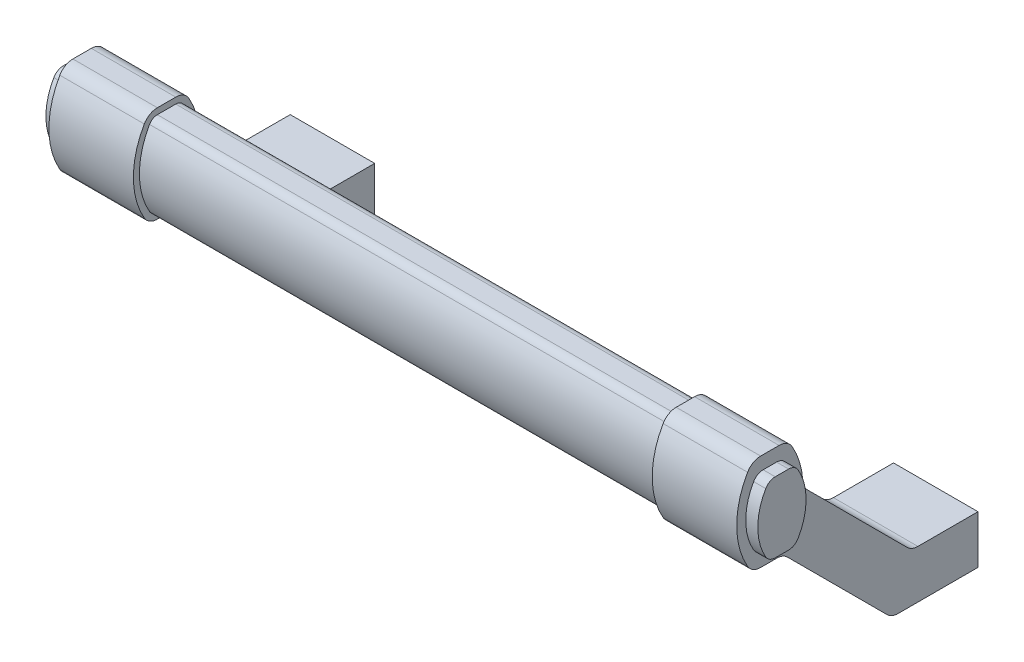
ISO-10303-21;
HEADER;
FILE_DESCRIPTION(('STEP AP214'),'2;1');
FILE_NAME('part.step','',(''),(''),'','','');
FILE_SCHEMA(('AUTOMOTIVE_DESIGN { 1 0 10303 214 1 1 1 1 }'));
ENDSEC;
DATA;
#1=APPLICATION_CONTEXT('core data for automotive mechanical design processes');
#2=APPLICATION_PROTOCOL_DEFINITION('international standard','automotive_design',2000,#1);
#3=PRODUCT_CONTEXT('',#1,'mechanical');
#4=PRODUCT('Part','Part','',(#3));
#5=PRODUCT_RELATED_PRODUCT_CATEGORY('part','',(#4));
#6=PRODUCT_DEFINITION_FORMATION('','',#4);
#7=PRODUCT_DEFINITION_CONTEXT('part definition',#1,'design');
#8=PRODUCT_DEFINITION('design','',#6,#7);
#9=PRODUCT_DEFINITION_SHAPE('','',#8);
#10=(LENGTH_UNIT() NAMED_UNIT(*) SI_UNIT(.MILLI.,.METRE.));
#11=(NAMED_UNIT(*) PLANE_ANGLE_UNIT() SI_UNIT($,.RADIAN.));
#12=(NAMED_UNIT(*) SI_UNIT($,.STERADIAN.) SOLID_ANGLE_UNIT());
#13=UNCERTAINTY_MEASURE_WITH_UNIT(LENGTH_MEASURE(1.E-05),#10,'distance_accuracy_value','');
#14=(GEOMETRIC_REPRESENTATION_CONTEXT(3) GLOBAL_UNCERTAINTY_ASSIGNED_CONTEXT((#13)) GLOBAL_UNIT_ASSIGNED_CONTEXT((#10,
#11,#12)) REPRESENTATION_CONTEXT('',''));
#15=CARTESIAN_POINT('',(0.,0.,0.));
#16=DIRECTION('',(0.,0.,1.));
#17=DIRECTION('',(1.,0.,0.));
#18=AXIS2_PLACEMENT_3D('',#15,#16,#17);
#19=CARTESIAN_POINT('',(-7.,4.,0.));
#20=DIRECTION('',(0.,0.,1.));
#21=DIRECTION('',(-1.,0.,0.));
#22=AXIS2_PLACEMENT_3D('',#19,#20,#21);
#23=PLANE('',#22);
#24=CARTESIAN_POINT('',(0.,0.,0.));
#25=DIRECTION('',(0.,0.,-1.));
#26=DIRECTION('',(1.,0.,0.));
#27=AXIS2_PLACEMENT_3D('',#24,#25,#26);
#28=CIRCLE('',#27,2.5);
#29=CARTESIAN_POINT('',(2.5,0.,0.));
#30=VERTEX_POINT('',#29);
#31=EDGE_CURVE('E610',#30,#30,#28,.T.);
#32=ORIENTED_EDGE('',*,*,#31,.F.);
#33=EDGE_LOOP('',(#32));
#34=FACE_BOUND('',#33,.T.);
#35=DIRECTION('',(1.,0.,0.));
#36=VECTOR('',#35,1.);
#37=CARTESIAN_POINT('',(-7.,-4.,0.));
#38=LINE('',#37,#36);
#39=CARTESIAN_POINT('',(-7.,-4.,0.));
#40=VERTEX_POINT('',#39);
#41=CARTESIAN_POINT('',(7.,-4.,0.));
#42=VERTEX_POINT('',#41);
#43=EDGE_CURVE('E9',#40,#42,#38,.T.);
#44=ORIENTED_EDGE('',*,*,#43,.F.);
#45=DIRECTION('',(0.,-1.,0.));
#46=VECTOR('',#45,1.);
#47=CARTESIAN_POINT('',(-7.,4.,0.));
#48=LINE('',#47,#46);
#49=CARTESIAN_POINT('',(-7.,4.,0.));
#50=VERTEX_POINT('',#49);
#51=EDGE_CURVE('E763',#50,#40,#48,.T.);
#52=ORIENTED_EDGE('',*,*,#51,.F.);
#53=DIRECTION('',(1.,0.,0.));
#54=VECTOR('',#53,1.);
#55=CARTESIAN_POINT('',(-7.,4.,0.));
#56=LINE('',#55,#54);
#57=CARTESIAN_POINT('',(7.,4.,0.));
#58=VERTEX_POINT('',#57);
#59=EDGE_CURVE('E811',#50,#58,#56,.T.);
#60=ORIENTED_EDGE('',*,*,#59,.T.);
#61=DIRECTION('',(0.,-1.,0.));
#62=VECTOR('',#61,1.);
#63=CARTESIAN_POINT('',(7.,4.,0.));
#64=LINE('',#63,#62);
#65=EDGE_CURVE('E715',#58,#42,#64,.T.);
#66=ORIENTED_EDGE('',*,*,#65,.T.);
#67=EDGE_LOOP('',(#44,#52,#60,#66));
#68=FACE_BOUND('',#67,.T.);
#69=ADVANCED_FACE('F14',(#34,#68),#23,.F.);
#70=CARTESIAN_POINT('',(-7.,-4.,0.));
#71=DIRECTION('',(0.,1.,0.));
#72=DIRECTION('',(-1.,0.,0.));
#73=AXIS2_PLACEMENT_3D('',#70,#71,#72);
#74=PLANE('',#73);
#75=DIRECTION('',(1.,0.,0.));
#76=VECTOR('',#75,1.);
#77=CARTESIAN_POINT('',(-7.,-4.,13.278174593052));
#78=LINE('',#77,#76);
#79=CARTESIAN_POINT('',(-7.,-4.,13.278174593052));
#80=VERTEX_POINT('',#79);
#81=CARTESIAN_POINT('',(7.,-4.,13.278174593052));
#82=VERTEX_POINT('',#81);
#83=EDGE_CURVE('E22',#80,#82,#78,.T.);
#84=ORIENTED_EDGE('',*,*,#83,.F.);
#85=DIRECTION('',(0.,0.,1.));
#86=VECTOR('',#85,1.);
#87=CARTESIAN_POINT('',(-7.,-4.,0.));
#88=LINE('',#87,#86);
#89=EDGE_CURVE('E766',#40,#80,#88,.T.);
#90=ORIENTED_EDGE('',*,*,#89,.F.);
#91=ORIENTED_EDGE('',*,*,#43,.T.);
#92=DIRECTION('',(0.,0.,1.));
#93=VECTOR('',#92,1.);
#94=CARTESIAN_POINT('',(7.,-4.,0.));
#95=LINE('',#94,#93);
#96=EDGE_CURVE('E718',#42,#82,#95,.T.);
#97=ORIENTED_EDGE('',*,*,#96,.T.);
#98=EDGE_LOOP('',(#84,#90,#91,#97));
#99=FACE_BOUND('',#98,.T.);
#100=ADVANCED_FACE('F16',(#99),#74,.F.);
#101=CARTESIAN_POINT('',(-7.,-1.5,13.278174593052));
#102=DIRECTION('',(1.,0.,0.));
#103=DIRECTION('',(0.,1.,0.));
#104=AXIS2_PLACEMENT_3D('',#101,#102,#103);
#105=CYLINDRICAL_SURFACE('',#104,2.49999999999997);
#106=DIRECTION('',(1.,0.,0.));
#107=VECTOR('',#106,1.);
#108=CARTESIAN_POINT('',(-7.,-3.26776695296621,15.0459415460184));
#109=LINE('',#108,#107);
#110=CARTESIAN_POINT('',(-7.,-3.26776695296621,15.0459415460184));
#111=VERTEX_POINT('',#110);
#112=CARTESIAN_POINT('',(7.,-3.26776695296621,15.0459415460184));
#113=VERTEX_POINT('',#112);
#114=EDGE_CURVE('E837',#111,#113,#109,.T.);
#115=ORIENTED_EDGE('',*,*,#114,.F.);
#116=CARTESIAN_POINT('',(-7.,-1.5,13.278174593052));
#117=DIRECTION('',(-1.,0.,0.));
#118=DIRECTION('',(0.,-1.,0.));
#119=AXIS2_PLACEMENT_3D('',#116,#117,#118);
#120=CIRCLE('',#119,2.49999999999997);
#121=EDGE_CURVE('E769',#80,#111,#120,.T.);
#122=ORIENTED_EDGE('',*,*,#121,.F.);
#123=ORIENTED_EDGE('',*,*,#83,.T.);
#124=CARTESIAN_POINT('',(7.,-1.5,13.278174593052));
#125=DIRECTION('',(-1.,0.,0.));
#126=DIRECTION('',(0.,-1.,0.));
#127=AXIS2_PLACEMENT_3D('',#124,#125,#126);
#128=CIRCLE('',#127,2.49999999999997);
#129=EDGE_CURVE('E721',#82,#113,#128,.T.);
#130=ORIENTED_EDGE('',*,*,#129,.T.);
#131=EDGE_LOOP('',(#115,#122,#123,#130));
#132=FACE_BOUND('',#131,.T.);
#133=ADVANCED_FACE('F840',(#132),#105,.T.);
#134=CARTESIAN_POINT('',(-7.,13.2677669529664,31.581475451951));
#135=DIRECTION('',(0.,-0.707106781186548,0.707106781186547));
#136=DIRECTION('',(0.,0.707106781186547,0.707106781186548));
#137=AXIS2_PLACEMENT_3D('',#134,#135,#136);
#138=PLANE('',#137);
#139=DIRECTION('',(1.,0.,0.));
#140=VECTOR('',#139,1.);
#141=CARTESIAN_POINT('',(-7.,13.2677669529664,31.581475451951));
#142=LINE('',#141,#140);
#143=CARTESIAN_POINT('',(-7.,13.2677669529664,31.581475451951));
#144=VERTEX_POINT('',#143);
#145=CARTESIAN_POINT('',(7.,13.2677669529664,31.581475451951));
#146=VERTEX_POINT('',#145);
#147=EDGE_CURVE('E835',#144,#146,#142,.T.);
#148=ORIENTED_EDGE('',*,*,#147,.F.);
#149=DIRECTION('',(0.,-0.707106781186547,-0.707106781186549));
#150=VECTOR('',#149,1.);
#151=CARTESIAN_POINT('',(-7.,13.2677669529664,31.581475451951));
#152=LINE('',#151,#150);
#153=EDGE_CURVE('E772',#144,#111,#152,.T.);
#154=ORIENTED_EDGE('',*,*,#153,.T.);
#155=ORIENTED_EDGE('',*,*,#114,.T.);
#156=DIRECTION('',(0.,-0.707106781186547,-0.707106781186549));
#157=VECTOR('',#156,1.);
#158=CARTESIAN_POINT('',(7.,13.2677669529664,31.581475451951));
#159=LINE('',#158,#157);
#160=EDGE_CURVE('E724',#146,#113,#159,.T.);
#161=ORIENTED_EDGE('',*,*,#160,.F.);
#162=EDGE_LOOP('',(#148,#154,#155,#161));
#163=FACE_BOUND('',#162,.T.);
#164=ADVANCED_FACE('F852',(#163),#138,.T.);
#165=CARTESIAN_POINT('',(-7.,11.5,33.3492424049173));
#166=DIRECTION('',(1.,0.,0.));
#167=DIRECTION('',(0.,1.,0.));
#168=AXIS2_PLACEMENT_3D('',#165,#166,#167);
#169=CYLINDRICAL_SURFACE('',#168,2.5);
#170=DIRECTION('',(1.,0.,0.));
#171=VECTOR('',#170,1.);
#172=CARTESIAN_POINT('',(-7.,14.,33.3492424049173));
#173=LINE('',#172,#171);
#174=CARTESIAN_POINT('',(-7.,14.,33.3492424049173));
#175=VERTEX_POINT('',#174);
#176=CARTESIAN_POINT('',(7.,14.,33.3492424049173));
#177=VERTEX_POINT('',#176);
#178=EDGE_CURVE('E833',#175,#177,#173,.T.);
#179=ORIENTED_EDGE('',*,*,#178,.F.);
#180=CARTESIAN_POINT('',(-7.,11.5,33.3492424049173));
#181=DIRECTION('',(-1.,0.,0.));
#182=DIRECTION('',(0.,-1.,0.));
#183=AXIS2_PLACEMENT_3D('',#180,#181,#182);
#184=CIRCLE('',#183,2.5);
#185=EDGE_CURVE('E775',#175,#144,#184,.T.);
#186=ORIENTED_EDGE('',*,*,#185,.T.);
#187=ORIENTED_EDGE('',*,*,#147,.T.);
#188=CARTESIAN_POINT('',(7.,11.5,33.3492424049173));
#189=DIRECTION('',(-1.,0.,0.));
#190=DIRECTION('',(0.,-1.,0.));
#191=AXIS2_PLACEMENT_3D('',#188,#189,#190);
#192=CIRCLE('',#191,2.5);
#193=EDGE_CURVE('E727',#177,#146,#192,.T.);
#194=ORIENTED_EDGE('',*,*,#193,.F.);
#195=EDGE_LOOP('',(#179,#186,#187,#194));
#196=FACE_BOUND('',#195,.T.);
#197=ADVANCED_FACE('F903',(#196),#169,.F.);
#198=CARTESIAN_POINT('',(-7.,14.,33.3492424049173));
#199=DIRECTION('',(0.,1.,0.));
#200=DIRECTION('',(-1.,0.,0.));
#201=AXIS2_PLACEMENT_3D('',#198,#199,#200);
#202=PLANE('',#201);
#203=DIRECTION('',(1.,0.,0.));
#204=VECTOR('',#203,1.);
#205=CARTESIAN_POINT('',(-7.,14.,36.0262794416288));
#206=LINE('',#205,#204);
#207=CARTESIAN_POINT('',(-7.,14.,36.0262794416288));
#208=VERTEX_POINT('',#207);
#209=CARTESIAN_POINT('',(7.,14.,36.0262794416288));
#210=VERTEX_POINT('',#209);
#211=EDGE_CURVE('E831',#208,#210,#206,.T.);
#212=ORIENTED_EDGE('',*,*,#211,.F.);
#213=DIRECTION('',(0.,0.,1.));
#214=VECTOR('',#213,1.);
#215=CARTESIAN_POINT('',(-7.,14.,33.3492424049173));
#216=LINE('',#215,#214);
#217=EDGE_CURVE('E778',#175,#208,#216,.T.);
#218=ORIENTED_EDGE('',*,*,#217,.F.);
#219=ORIENTED_EDGE('',*,*,#178,.T.);
#220=DIRECTION('',(0.,0.,1.));
#221=VECTOR('',#220,1.);
#222=CARTESIAN_POINT('',(7.,14.,33.3492424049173));
#223=LINE('',#222,#221);
#224=EDGE_CURVE('E730',#177,#210,#223,.T.);
#225=ORIENTED_EDGE('',*,*,#224,.T.);
#226=EDGE_LOOP('',(#212,#218,#219,#225));
#227=FACE_BOUND('',#226,.T.);
#228=ADVANCED_FACE('F901',(#227),#202,.F.);
#229=CARTESIAN_POINT('',(-7.,16.5,36.0262794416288));
#230=DIRECTION('',(1.,0.,0.));
#231=DIRECTION('',(0.,1.,0.));
#232=AXIS2_PLACEMENT_3D('',#229,#230,#231);
#233=CYLINDRICAL_SURFACE('',#232,2.5);
#234=DIRECTION('',(1.,0.,0.));
#235=VECTOR('',#234,1.);
#236=CARTESIAN_POINT('',(-7.,15.25,38.1913429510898));
#237=LINE('',#236,#235);
#238=CARTESIAN_POINT('',(-7.,15.25,38.1913429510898));
#239=VERTEX_POINT('',#238);
#240=CARTESIAN_POINT('',(7.,15.25,38.1913429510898));
#241=VERTEX_POINT('',#240);
#242=EDGE_CURVE('E829',#239,#241,#237,.T.);
#243=ORIENTED_EDGE('',*,*,#242,.F.);
#244=CARTESIAN_POINT('',(-7.,16.5,36.0262794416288));
#245=DIRECTION('',(-1.,0.,0.));
#246=DIRECTION('',(0.,-1.,0.));
#247=AXIS2_PLACEMENT_3D('',#244,#245,#246);
#248=CIRCLE('',#247,2.5);
#249=EDGE_CURVE('E781',#208,#239,#248,.T.);
#250=ORIENTED_EDGE('',*,*,#249,.F.);
#251=ORIENTED_EDGE('',*,*,#211,.T.);
#252=CARTESIAN_POINT('',(7.,16.5,36.0262794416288));
#253=DIRECTION('',(-1.,0.,0.));
#254=DIRECTION('',(0.,-1.,0.));
#255=AXIS2_PLACEMENT_3D('',#252,#253,#254);
#256=CIRCLE('',#255,2.5);
#257=EDGE_CURVE('E733',#210,#241,#256,.T.);
#258=ORIENTED_EDGE('',*,*,#257,.T.);
#259=EDGE_LOOP('',(#243,#250,#251,#258));
#260=FACE_BOUND('',#259,.T.);
#261=ADVANCED_FACE('F898',(#260),#233,.T.);
#262=CARTESIAN_POINT('',(-7.,22.,26.5));
#263=DIRECTION('',(1.,0.,0.));
#264=DIRECTION('',(0.,1.,0.));
#265=AXIS2_PLACEMENT_3D('',#262,#263,#264);
#266=CYLINDRICAL_SURFACE('',#265,13.5);
#267=DIRECTION('',(1.,0.,0.));
#268=VECTOR('',#267,1.);
#269=CARTESIAN_POINT('',(-7.,28.75,38.1913429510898));
#270=LINE('',#269,#268);
#271=CARTESIAN_POINT('',(-7.,28.75,38.1913429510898));
#272=VERTEX_POINT('',#271);
#273=CARTESIAN_POINT('',(7.,28.75,38.1913429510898));
#274=VERTEX_POINT('',#273);
#275=EDGE_CURVE('E827',#272,#274,#270,.T.);
#276=ORIENTED_EDGE('',*,*,#275,.F.);
#277=CARTESIAN_POINT('',(-7.,22.,26.5));
#278=DIRECTION('',(-1.,0.,0.));
#279=DIRECTION('',(0.,-1.,0.));
#280=AXIS2_PLACEMENT_3D('',#277,#278,#279);
#281=CIRCLE('',#280,13.5);
#282=EDGE_CURVE('E784',#239,#272,#281,.T.);
#283=ORIENTED_EDGE('',*,*,#282,.F.);
#284=ORIENTED_EDGE('',*,*,#242,.T.);
#285=CARTESIAN_POINT('',(7.,22.,26.5));
#286=DIRECTION('',(-1.,0.,0.));
#287=DIRECTION('',(0.,-1.,0.));
#288=AXIS2_PLACEMENT_3D('',#285,#286,#287);
#289=CIRCLE('',#288,13.5);
#290=EDGE_CURVE('E736',#241,#274,#289,.T.);
#291=ORIENTED_EDGE('',*,*,#290,.T.);
#292=EDGE_LOOP('',(#276,#283,#284,#291));
#293=FACE_BOUND('',#292,.T.);
#294=ADVANCED_FACE('F894',(#293),#266,.T.);
#295=CARTESIAN_POINT('',(-7.,27.5,36.0262794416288));
#296=DIRECTION('',(1.,0.,0.));
#297=DIRECTION('',(0.,1.,0.));
#298=AXIS2_PLACEMENT_3D('',#295,#296,#297);
#299=CYLINDRICAL_SURFACE('',#298,2.5);
#300=DIRECTION('',(1.,0.,0.));
#301=VECTOR('',#300,1.);
#302=CARTESIAN_POINT('',(-7.,30.,36.0262794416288));
#303=LINE('',#302,#301);
#304=CARTESIAN_POINT('',(-7.,30.,36.0262794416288));
#305=VERTEX_POINT('',#304);
#306=CARTESIAN_POINT('',(7.,30.,36.0262794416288));
#307=VERTEX_POINT('',#306);
#308=EDGE_CURVE('E825',#305,#307,#303,.T.);
#309=ORIENTED_EDGE('',*,*,#308,.F.);
#310=CARTESIAN_POINT('',(-7.,27.5,36.0262794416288));
#311=DIRECTION('',(-1.,0.,0.));
#312=DIRECTION('',(0.,-1.,0.));
#313=AXIS2_PLACEMENT_3D('',#310,#311,#312);
#314=CIRCLE('',#313,2.5);
#315=EDGE_CURVE('E787',#272,#305,#314,.T.);
#316=ORIENTED_EDGE('',*,*,#315,.F.);
#317=ORIENTED_EDGE('',*,*,#275,.T.);
#318=CARTESIAN_POINT('',(7.,27.5,36.0262794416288));
#319=DIRECTION('',(-1.,0.,0.));
#320=DIRECTION('',(0.,-1.,0.));
#321=AXIS2_PLACEMENT_3D('',#318,#319,#320);
#322=CIRCLE('',#321,2.5);
#323=EDGE_CURVE('E739',#274,#307,#322,.T.);
#324=ORIENTED_EDGE('',*,*,#323,.T.);
#325=EDGE_LOOP('',(#309,#316,#317,#324));
#326=FACE_BOUND('',#325,.T.);
#327=ADVANCED_FACE('F890',(#326),#299,.T.);
#328=CARTESIAN_POINT('',(-7.,30.,32.9737205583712));
#329=DIRECTION('',(0.,1.,0.));
#330=DIRECTION('',(-1.,0.,0.));
#331=AXIS2_PLACEMENT_3D('',#328,#329,#330);
#332=PLANE('',#331);
#333=DIRECTION('',(1.,0.,0.));
#334=VECTOR('',#333,1.);
#335=CARTESIAN_POINT('',(-7.,30.,32.9737205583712));
#336=LINE('',#335,#334);
#337=CARTESIAN_POINT('',(-7.,30.,32.9737205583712));
#338=VERTEX_POINT('',#337);
#339=CARTESIAN_POINT('',(7.,30.,32.9737205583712));
#340=VERTEX_POINT('',#339);
#341=EDGE_CURVE('E823',#338,#340,#336,.T.);
#342=ORIENTED_EDGE('',*,*,#341,.F.);
#343=DIRECTION('',(0.,0.,1.));
#344=VECTOR('',#343,1.);
#345=CARTESIAN_POINT('',(-7.,30.,32.9737205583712));
#346=LINE('',#345,#344);
#347=EDGE_CURVE('E790',#338,#305,#346,.T.);
#348=ORIENTED_EDGE('',*,*,#347,.T.);
#349=ORIENTED_EDGE('',*,*,#308,.T.);
#350=DIRECTION('',(0.,0.,1.));
#351=VECTOR('',#350,1.);
#352=CARTESIAN_POINT('',(7.,30.,32.9737205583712));
#353=LINE('',#352,#351);
#354=EDGE_CURVE('E742',#340,#307,#353,.T.);
#355=ORIENTED_EDGE('',*,*,#354,.F.);
#356=EDGE_LOOP('',(#342,#348,#349,#355));
#357=FACE_BOUND('',#356,.T.);
#358=ADVANCED_FACE('F887',(#357),#332,.T.);
#359=CARTESIAN_POINT('',(-7.,27.5,32.9737205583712));
#360=DIRECTION('',(1.,0.,0.));
#361=DIRECTION('',(0.,1.,0.));
#362=AXIS2_PLACEMENT_3D('',#359,#360,#361);
#363=CYLINDRICAL_SURFACE('',#362,2.5);
#364=DIRECTION('',(1.,0.,0.));
#365=VECTOR('',#364,1.);
#366=CARTESIAN_POINT('',(-7.,28.75,30.80865704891));
#367=LINE('',#366,#365);
#368=CARTESIAN_POINT('',(-7.,28.75,30.80865704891));
#369=VERTEX_POINT('',#368);
#370=CARTESIAN_POINT('',(7.,28.75,30.80865704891));
#371=VERTEX_POINT('',#370);
#372=EDGE_CURVE('E821',#369,#371,#367,.T.);
#373=ORIENTED_EDGE('',*,*,#372,.F.);
#374=CARTESIAN_POINT('',(-7.,27.5,32.9737205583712));
#375=DIRECTION('',(-1.,0.,0.));
#376=DIRECTION('',(0.,-1.,0.));
#377=AXIS2_PLACEMENT_3D('',#374,#375,#376);
#378=CIRCLE('',#377,2.5);
#379=EDGE_CURVE('E793',#338,#369,#378,.T.);
#380=ORIENTED_EDGE('',*,*,#379,.F.);
#381=ORIENTED_EDGE('',*,*,#341,.T.);
#382=CARTESIAN_POINT('',(7.,27.5,32.9737205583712));
#383=DIRECTION('',(-1.,0.,0.));
#384=DIRECTION('',(0.,-1.,0.));
#385=AXIS2_PLACEMENT_3D('',#382,#383,#384);
#386=CIRCLE('',#385,2.5);
#387=EDGE_CURVE('E745',#340,#371,#386,.T.);
#388=ORIENTED_EDGE('',*,*,#387,.T.);
#389=EDGE_LOOP('',(#373,#380,#381,#388));
#390=FACE_BOUND('',#389,.T.);
#391=ADVANCED_FACE('F883',(#390),#363,.T.);
#392=CARTESIAN_POINT('',(-7.,22.,42.5));
#393=DIRECTION('',(1.,0.,0.));
#394=DIRECTION('',(0.,1.,0.));
#395=AXIS2_PLACEMENT_3D('',#392,#393,#394);
#396=CYLINDRICAL_SURFACE('',#395,13.5);
#397=DIRECTION('',(1.,0.,0.));
#398=VECTOR('',#397,1.);
#399=CARTESIAN_POINT('',(-7.,22.9040353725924,29.0303036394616));
#400=LINE('',#399,#398);
#401=CARTESIAN_POINT('',(-7.,22.9040353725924,29.0303036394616));
#402=VERTEX_POINT('',#401);
#403=CARTESIAN_POINT('',(7.,22.9040353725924,29.0303036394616));
#404=VERTEX_POINT('',#403);
#405=EDGE_CURVE('E819',#402,#404,#400,.T.);
#406=ORIENTED_EDGE('',*,*,#405,.F.);
#407=CARTESIAN_POINT('',(-7.,22.,42.5));
#408=DIRECTION('',(-1.,0.,0.));
#409=DIRECTION('',(0.,-1.,0.));
#410=AXIS2_PLACEMENT_3D('',#407,#408,#409);
#411=CIRCLE('',#410,13.5);
#412=EDGE_CURVE('E796',#369,#402,#411,.T.);
#413=ORIENTED_EDGE('',*,*,#412,.F.);
#414=ORIENTED_EDGE('',*,*,#372,.T.);
#415=CARTESIAN_POINT('',(7.,22.,42.5));
#416=DIRECTION('',(-1.,0.,0.));
#417=DIRECTION('',(0.,-1.,0.));
#418=AXIS2_PLACEMENT_3D('',#415,#416,#417);
#419=CIRCLE('',#418,13.5);
#420=EDGE_CURVE('E748',#371,#404,#419,.T.);
#421=ORIENTED_EDGE('',*,*,#420,.T.);
#422=EDGE_LOOP('',(#406,#413,#414,#421));
#423=FACE_BOUND('',#422,.T.);
#424=ADVANCED_FACE('F878',(#423),#396,.T.);
#425=CARTESIAN_POINT('',(-7.,23.0714493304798,26.535915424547));
#426=DIRECTION('',(1.,0.,0.));
#427=DIRECTION('',(0.,1.,0.));
#428=AXIS2_PLACEMENT_3D('',#425,#426,#427);
#429=CYLINDRICAL_SURFACE('',#428,2.5);
#430=DIRECTION('',(1.,0.,0.));
#431=VECTOR('',#430,1.);
#432=CARTESIAN_POINT('',(-7.,21.3036823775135,28.3036823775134));
#433=LINE('',#432,#431);
#434=CARTESIAN_POINT('',(-7.,21.3036823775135,28.3036823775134));
#435=VERTEX_POINT('',#434);
#436=CARTESIAN_POINT('',(7.,21.3036823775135,28.3036823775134));
#437=VERTEX_POINT('',#436);
#438=EDGE_CURVE('E817',#435,#437,#433,.T.);
#439=ORIENTED_EDGE('',*,*,#438,.F.);
#440=CARTESIAN_POINT('',(-7.,23.0714493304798,26.535915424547));
#441=DIRECTION('',(-1.,0.,0.));
#442=DIRECTION('',(0.,-1.,0.));
#443=AXIS2_PLACEMENT_3D('',#440,#441,#442);
#444=CIRCLE('',#443,2.5);
#445=EDGE_CURVE('E799',#435,#402,#444,.T.);
#446=ORIENTED_EDGE('',*,*,#445,.T.);
#447=ORIENTED_EDGE('',*,*,#405,.T.);
#448=CARTESIAN_POINT('',(7.,23.0714493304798,26.535915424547));
#449=DIRECTION('',(-1.,0.,0.));
#450=DIRECTION('',(0.,-1.,0.));
#451=AXIS2_PLACEMENT_3D('',#448,#449,#450);
#452=CIRCLE('',#451,2.5);
#453=EDGE_CURVE('E751',#437,#404,#452,.T.);
#454=ORIENTED_EDGE('',*,*,#453,.F.);
#455=EDGE_LOOP('',(#439,#446,#447,#454));
#456=FACE_BOUND('',#455,.T.);
#457=ADVANCED_FACE('F875',(#456),#429,.F.);
#458=CARTESIAN_POINT('',(-7.,21.3036823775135,28.3036823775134));
#459=DIRECTION('',(0.,-0.707106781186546,0.707106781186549));
#460=DIRECTION('',(0.,0.707106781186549,0.707106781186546));
#461=AXIS2_PLACEMENT_3D('',#458,#459,#460);
#462=PLANE('',#461);
#463=DIRECTION('',(1.,0.,0.));
#464=VECTOR('',#463,1.);
#465=CARTESIAN_POINT('',(-7.,4.7322330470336,11.7322330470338));
#466=LINE('',#465,#464);
#467=CARTESIAN_POINT('',(-7.,4.7322330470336,11.7322330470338));
#468=VERTEX_POINT('',#467);
#469=CARTESIAN_POINT('',(7.,4.7322330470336,11.7322330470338));
#470=VERTEX_POINT('',#469);
#471=EDGE_CURVE('E815',#468,#470,#466,.T.);
#472=ORIENTED_EDGE('',*,*,#471,.F.);
#473=DIRECTION('',(0.,-0.707106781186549,-0.707106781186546));
#474=VECTOR('',#473,1.);
#475=CARTESIAN_POINT('',(-7.,21.3036823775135,28.3036823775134));
#476=LINE('',#475,#474);
#477=EDGE_CURVE('E802',#435,#468,#476,.T.);
#478=ORIENTED_EDGE('',*,*,#477,.F.);
#479=ORIENTED_EDGE('',*,*,#438,.T.);
#480=DIRECTION('',(0.,-0.707106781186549,-0.707106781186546));
#481=VECTOR('',#480,1.);
#482=CARTESIAN_POINT('',(7.,21.3036823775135,28.3036823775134));
#483=LINE('',#482,#481);
#484=EDGE_CURVE('E754',#437,#470,#483,.T.);
#485=ORIENTED_EDGE('',*,*,#484,.T.);
#486=EDGE_LOOP('',(#472,#478,#479,#485));
#487=FACE_BOUND('',#486,.T.);
#488=ADVANCED_FACE('F871',(#487),#462,.F.);
#489=CARTESIAN_POINT('',(-7.,6.5,9.9644660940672));
#490=DIRECTION('',(1.,0.,0.));
#491=DIRECTION('',(0.,1.,0.));
#492=AXIS2_PLACEMENT_3D('',#489,#490,#491);
#493=CYLINDRICAL_SURFACE('',#492,2.5);
#494=DIRECTION('',(1.,0.,0.));
#495=VECTOR('',#494,1.);
#496=CARTESIAN_POINT('',(-7.,4.,9.9644660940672));
#497=LINE('',#496,#495);
#498=CARTESIAN_POINT('',(-7.,4.,9.9644660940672));
#499=VERTEX_POINT('',#498);
#500=CARTESIAN_POINT('',(7.,4.,9.9644660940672));
#501=VERTEX_POINT('',#500);
#502=EDGE_CURVE('E813',#499,#501,#497,.T.);
#503=ORIENTED_EDGE('',*,*,#502,.F.);
#504=CARTESIAN_POINT('',(-7.,6.5,9.9644660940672));
#505=DIRECTION('',(-1.,0.,0.));
#506=DIRECTION('',(0.,-1.,0.));
#507=AXIS2_PLACEMENT_3D('',#504,#505,#506);
#508=CIRCLE('',#507,2.5);
#509=EDGE_CURVE('E805',#499,#468,#508,.T.);
#510=ORIENTED_EDGE('',*,*,#509,.T.);
#511=ORIENTED_EDGE('',*,*,#471,.T.);
#512=CARTESIAN_POINT('',(7.,6.5,9.9644660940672));
#513=DIRECTION('',(-1.,0.,0.));
#514=DIRECTION('',(0.,-1.,0.));
#515=AXIS2_PLACEMENT_3D('',#512,#513,#514);
#516=CIRCLE('',#515,2.5);
#517=EDGE_CURVE('E757',#501,#470,#516,.T.);
#518=ORIENTED_EDGE('',*,*,#517,.F.);
#519=EDGE_LOOP('',(#503,#510,#511,#518));
#520=FACE_BOUND('',#519,.T.);
#521=ADVANCED_FACE('F866',(#520),#493,.F.);
#522=CARTESIAN_POINT('',(-7.,4.,0.));
#523=DIRECTION('',(0.,1.,0.));
#524=DIRECTION('',(-1.,0.,0.));
#525=AXIS2_PLACEMENT_3D('',#522,#523,#524);
#526=PLANE('',#525);
#527=DIRECTION('',(0.,0.,1.));
#528=VECTOR('',#527,1.);
#529=CARTESIAN_POINT('',(-7.,4.,0.));
#530=LINE('',#529,#528);
#531=EDGE_CURVE('E808',#50,#499,#530,.T.);
#532=ORIENTED_EDGE('',*,*,#531,.T.);
#533=ORIENTED_EDGE('',*,*,#502,.T.);
#534=DIRECTION('',(0.,0.,1.));
#535=VECTOR('',#534,1.);
#536=CARTESIAN_POINT('',(7.,4.,0.));
#537=LINE('',#536,#535);
#538=EDGE_CURVE('E760',#58,#501,#537,.T.);
#539=ORIENTED_EDGE('',*,*,#538,.F.);
#540=ORIENTED_EDGE('',*,*,#59,.F.);
#541=EDGE_LOOP('',(#532,#533,#539,#540));
#542=FACE_BOUND('',#541,.T.);
#543=ADVANCED_FACE('F863',(#542),#526,.T.);
#544=CARTESIAN_POINT('',(-7.,-1.5,13.278174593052));
#545=DIRECTION('',(-1.,0.,0.));
#546=DIRECTION('',(0.,-1.,0.));
#547=AXIS2_PLACEMENT_3D('',#544,#545,#546);
#548=PLANE('',#547);
#549=CARTESIAN_POINT('',(-7.,18.,35.6100214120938));
#550=DIRECTION('',(-1.,0.,0.));
#551=DIRECTION('',(0.,-1.,0.));
#552=AXIS2_PLACEMENT_3D('',#549,#550,#551);
#553=CIRCLE('',#552,1.81818181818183);
#554=CARTESIAN_POINT('',(-7.,16.1818181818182,35.6100214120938));
#555=VERTEX_POINT('',#554);
#556=CARTESIAN_POINT('',(-7.,17.0909090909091,37.1846130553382));
#557=VERTEX_POINT('',#556);
#558=EDGE_CURVE('E37',#555,#557,#553,.T.);
#559=ORIENTED_EDGE('',*,*,#558,.F.);
#560=DIRECTION('',(0.,0.,1.));
#561=VECTOR('',#560,1.);
#562=CARTESIAN_POINT('',(-7.,16.1818181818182,33.3899785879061));
#563=LINE('',#562,#561);
#564=CARTESIAN_POINT('',(-7.,16.1818181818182,33.3899785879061));
#565=VERTEX_POINT('',#564);
#566=EDGE_CURVE('E665',#565,#555,#563,.T.);
#567=ORIENTED_EDGE('',*,*,#566,.F.);
#568=CARTESIAN_POINT('',(-7.,18.,33.3899785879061));
#569=DIRECTION('',(-1.,0.,0.));
#570=DIRECTION('',(0.,-1.,0.));
#571=AXIS2_PLACEMENT_3D('',#568,#569,#570);
#572=CIRCLE('',#571,1.81818181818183);
#573=CARTESIAN_POINT('',(-7.,17.0909090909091,31.8153869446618));
#574=VERTEX_POINT('',#573);
#575=EDGE_CURVE('E662',#574,#565,#572,.T.);
#576=ORIENTED_EDGE('',*,*,#575,.F.);
#577=CARTESIAN_POINT('',(-7.,22.,40.3181818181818));
#578=DIRECTION('',(-1.,0.,0.));
#579=DIRECTION('',(0.,-1.,0.));
#580=AXIS2_PLACEMENT_3D('',#577,#578,#579);
#581=CIRCLE('',#580,9.81818181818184);
#582=CARTESIAN_POINT('',(-7.,26.9090909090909,31.8153869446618));
#583=VERTEX_POINT('',#582);
#584=EDGE_CURVE('E659',#583,#574,#581,.T.);
#585=ORIENTED_EDGE('',*,*,#584,.F.);
#586=CARTESIAN_POINT('',(-7.,26.,33.3899785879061));
#587=DIRECTION('',(-1.,0.,0.));
#588=DIRECTION('',(0.,-1.,0.));
#589=AXIS2_PLACEMENT_3D('',#586,#587,#588);
#590=CIRCLE('',#589,1.81818181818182);
#591=CARTESIAN_POINT('',(-7.,27.8181818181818,33.3899785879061));
#592=VERTEX_POINT('',#591);
#593=EDGE_CURVE('E656',#592,#583,#590,.T.);
#594=ORIENTED_EDGE('',*,*,#593,.F.);
#595=DIRECTION('',(0.,0.,1.));
#596=VECTOR('',#595,1.);
#597=CARTESIAN_POINT('',(-7.,27.8181818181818,33.3899785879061));
#598=LINE('',#597,#596);
#599=CARTESIAN_POINT('',(-7.,27.8181818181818,35.6100214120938));
#600=VERTEX_POINT('',#599);
#601=EDGE_CURVE('E654',#592,#600,#598,.T.);
#602=ORIENTED_EDGE('',*,*,#601,.T.);
#603=CARTESIAN_POINT('',(-7.,26.,35.6100214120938));
#604=DIRECTION('',(-1.,0.,0.));
#605=DIRECTION('',(0.,-1.,0.));
#606=AXIS2_PLACEMENT_3D('',#603,#604,#605);
#607=CIRCLE('',#606,1.81818181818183);
#608=CARTESIAN_POINT('',(-7.,26.9090909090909,37.1846130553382));
#609=VERTEX_POINT('',#608);
#610=EDGE_CURVE('E651',#609,#600,#607,.T.);
#611=ORIENTED_EDGE('',*,*,#610,.F.);
#612=CARTESIAN_POINT('',(-7.,22.,28.6818181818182));
#613=DIRECTION('',(-1.,0.,0.));
#614=DIRECTION('',(0.,-1.,0.));
#615=AXIS2_PLACEMENT_3D('',#612,#613,#614);
#616=CIRCLE('',#615,9.81818181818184);
#617=EDGE_CURVE('E648',#557,#609,#616,.T.);
#618=ORIENTED_EDGE('',*,*,#617,.F.);
#619=EDGE_LOOP('',(#559,#567,#576,#585,#594,#602,#611,#618));
#620=FACE_BOUND('',#619,.T.);
#621=ORIENTED_EDGE('',*,*,#51,.T.);
#622=ORIENTED_EDGE('',*,*,#89,.T.);
#623=ORIENTED_EDGE('',*,*,#121,.T.);
#624=ORIENTED_EDGE('',*,*,#153,.F.);
#625=ORIENTED_EDGE('',*,*,#185,.F.);
#626=ORIENTED_EDGE('',*,*,#217,.T.);
#627=ORIENTED_EDGE('',*,*,#249,.T.);
#628=ORIENTED_EDGE('',*,*,#282,.T.);
#629=ORIENTED_EDGE('',*,*,#315,.T.);
#630=ORIENTED_EDGE('',*,*,#347,.F.);
#631=ORIENTED_EDGE('',*,*,#379,.T.);
#632=ORIENTED_EDGE('',*,*,#412,.T.);
#633=ORIENTED_EDGE('',*,*,#445,.F.);
#634=ORIENTED_EDGE('',*,*,#477,.T.);
#635=ORIENTED_EDGE('',*,*,#509,.F.);
#636=ORIENTED_EDGE('',*,*,#531,.F.);
#637=EDGE_LOOP('',(#621,#622,#623,#624,#625,#626,#627,#628,#629,#630,#631,#632,#633,#634,#635,#636));
#638=FACE_BOUND('',#637,.T.);
#639=ADVANCED_FACE('F855',(#620,#638),#548,.T.);
#640=CARTESIAN_POINT('',(7.,-1.5,13.278174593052));
#641=DIRECTION('',(-1.,0.,0.));
#642=DIRECTION('',(0.,-1.,0.));
#643=AXIS2_PLACEMENT_3D('',#640,#641,#642);
#644=PLANE('',#643);
#645=CARTESIAN_POINT('',(7.,27.5,32.973720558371));
#646=DIRECTION('',(-1.,0.,0.));
#647=DIRECTION('',(0.,-1.,0.));
#648=AXIS2_PLACEMENT_3D('',#645,#646,#647);
#649=CIRCLE('',#648,1.5);
#650=CARTESIAN_POINT('',(7.,29.,32.9737205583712));
#651=VERTEX_POINT('',#650);
#652=CARTESIAN_POINT('',(7.,28.25,31.6746824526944));
#653=VERTEX_POINT('',#652);
#654=EDGE_CURVE('E374',#651,#653,#649,.T.);
#655=ORIENTED_EDGE('',*,*,#654,.T.);
#656=CARTESIAN_POINT('',(7.,22.,42.5));
#657=DIRECTION('',(-1.,0.,0.));
#658=DIRECTION('',(0.,-1.,0.));
#659=AXIS2_PLACEMENT_3D('',#656,#657,#658);
#660=CIRCLE('',#659,12.5);
#661=CARTESIAN_POINT('',(7.,15.75,31.6746824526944));
#662=VERTEX_POINT('',#661);
#663=EDGE_CURVE('E29',#653,#662,#660,.T.);
#664=ORIENTED_EDGE('',*,*,#663,.T.);
#665=CARTESIAN_POINT('',(7.,16.5,32.973720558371));
#666=DIRECTION('',(-1.,0.,0.));
#667=DIRECTION('',(0.,-1.,0.));
#668=AXIS2_PLACEMENT_3D('',#665,#666,#667);
#669=CIRCLE('',#668,1.49999999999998);
#670=CARTESIAN_POINT('',(7.,15.,32.973720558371));
#671=VERTEX_POINT('',#670);
#672=EDGE_CURVE('E371',#662,#671,#669,.T.);
#673=ORIENTED_EDGE('',*,*,#672,.T.);
#674=DIRECTION('',(0.,0.,1.));
#675=VECTOR('',#674,1.);
#676=CARTESIAN_POINT('',(7.,15.,32.973720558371));
#677=LINE('',#676,#675);
#678=CARTESIAN_POINT('',(7.,15.,36.0262794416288));
#679=VERTEX_POINT('',#678);
#680=EDGE_CURVE('E618',#671,#679,#677,.T.);
#681=ORIENTED_EDGE('',*,*,#680,.T.);
#682=CARTESIAN_POINT('',(7.,16.5,36.0262794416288));
#683=DIRECTION('',(1.,0.,0.));
#684=DIRECTION('',(0.,1.,0.));
#685=AXIS2_PLACEMENT_3D('',#682,#683,#684);
#686=CIRCLE('',#685,1.49999999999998);
#687=CARTESIAN_POINT('',(7.,15.75,37.3253175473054));
#688=VERTEX_POINT('',#687);
#689=EDGE_CURVE('E621',#688,#679,#686,.T.);
#690=ORIENTED_EDGE('',*,*,#689,.F.);
#691=CARTESIAN_POINT('',(7.,22.,26.5));
#692=DIRECTION('',(1.,0.,0.));
#693=DIRECTION('',(0.,1.,0.));
#694=AXIS2_PLACEMENT_3D('',#691,#692,#693);
#695=CIRCLE('',#694,12.5);
#696=CARTESIAN_POINT('',(7.,28.25,37.3253175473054));
#697=VERTEX_POINT('',#696);
#698=EDGE_CURVE('E624',#697,#688,#695,.T.);
#699=ORIENTED_EDGE('',*,*,#698,.F.);
#700=CARTESIAN_POINT('',(7.,27.5,36.0262794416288));
#701=DIRECTION('',(1.,0.,0.));
#702=DIRECTION('',(0.,1.,0.));
#703=AXIS2_PLACEMENT_3D('',#700,#701,#702);
#704=CIRCLE('',#703,1.5);
#705=CARTESIAN_POINT('',(7.,29.,36.0262794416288));
#706=VERTEX_POINT('',#705);
#707=EDGE_CURVE('E627',#706,#697,#704,.T.);
#708=ORIENTED_EDGE('',*,*,#707,.F.);
#709=DIRECTION('',(0.,0.,1.));
#710=VECTOR('',#709,1.);
#711=CARTESIAN_POINT('',(7.,29.,32.9737205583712));
#712=LINE('',#711,#710);
#713=EDGE_CURVE('E630',#651,#706,#712,.T.);
#714=ORIENTED_EDGE('',*,*,#713,.F.);
#715=EDGE_LOOP('',(#655,#664,#673,#681,#690,#699,#708,#714));
#716=FACE_BOUND('',#715,.T.);
#717=ORIENTED_EDGE('',*,*,#65,.F.);
#718=ORIENTED_EDGE('',*,*,#538,.T.);
#719=ORIENTED_EDGE('',*,*,#517,.T.);
#720=ORIENTED_EDGE('',*,*,#484,.F.);
#721=ORIENTED_EDGE('',*,*,#453,.T.);
#722=ORIENTED_EDGE('',*,*,#420,.F.);
#723=ORIENTED_EDGE('',*,*,#387,.F.);
#724=ORIENTED_EDGE('',*,*,#354,.T.);
#725=ORIENTED_EDGE('',*,*,#323,.F.);
#726=ORIENTED_EDGE('',*,*,#290,.F.);
#727=ORIENTED_EDGE('',*,*,#257,.F.);
#728=ORIENTED_EDGE('',*,*,#224,.F.);
#729=ORIENTED_EDGE('',*,*,#193,.T.);
#730=ORIENTED_EDGE('',*,*,#160,.T.);
#731=ORIENTED_EDGE('',*,*,#129,.F.);
#732=ORIENTED_EDGE('',*,*,#96,.F.);
#733=EDGE_LOOP('',(#717,#718,#719,#720,#721,#722,#723,#724,#725,#726,#727,#728,#729,#730,#731,#732));
#734=FACE_BOUND('',#733,.T.);
#735=ADVANCED_FACE('F847',(#716,#734),#644,.F.);
#736=CARTESIAN_POINT('',(-9.,18.,35.6100214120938));
#737=DIRECTION('',(1.,0.,0.));
#738=DIRECTION('',(0.,1.,0.));
#739=AXIS2_PLACEMENT_3D('',#736,#737,#738);
#740=CYLINDRICAL_SURFACE('',#739,1.81818181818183);
#741=DIRECTION('',(1.,0.,0.));
#742=VECTOR('',#741,1.);
#743=CARTESIAN_POINT('',(-9.,17.0909090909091,37.1846130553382));
#744=LINE('',#743,#742);
#745=CARTESIAN_POINT('',(-9.,17.0909090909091,37.1846130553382));
#746=VERTEX_POINT('',#745);
#747=EDGE_CURVE('E712',#746,#557,#744,.T.);
#748=ORIENTED_EDGE('',*,*,#747,.F.);
#749=CARTESIAN_POINT('',(-9.,18.,35.6100214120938));
#750=DIRECTION('',(-1.,0.,0.));
#751=DIRECTION('',(0.,-1.,0.));
#752=AXIS2_PLACEMENT_3D('',#749,#750,#751);
#753=CIRCLE('',#752,1.81818181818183);
#754=CARTESIAN_POINT('',(-9.,16.1818181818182,35.6100214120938));
#755=VERTEX_POINT('',#754);
#756=EDGE_CURVE('E668',#755,#746,#753,.T.);
#757=ORIENTED_EDGE('',*,*,#756,.F.);
#758=DIRECTION('',(1.,0.,0.));
#759=VECTOR('',#758,1.);
#760=CARTESIAN_POINT('',(-9.,16.1818181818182,35.6100214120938));
#761=LINE('',#760,#759);
#762=EDGE_CURVE('E692',#755,#555,#761,.T.);
#763=ORIENTED_EDGE('',*,*,#762,.T.);
#764=ORIENTED_EDGE('',*,*,#558,.T.);
#765=EDGE_LOOP('',(#748,#757,#763,#764));
#766=FACE_BOUND('',#765,.T.);
#767=ADVANCED_FACE('F995',(#766),#740,.T.);
#768=CARTESIAN_POINT('',(-9.,22.,28.6818181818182));
#769=DIRECTION('',(1.,0.,0.));
#770=DIRECTION('',(0.,1.,0.));
#771=AXIS2_PLACEMENT_3D('',#768,#769,#770);
#772=CYLINDRICAL_SURFACE('',#771,9.81818181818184);
#773=DIRECTION('',(1.,0.,0.));
#774=VECTOR('',#773,1.);
#775=CARTESIAN_POINT('',(-9.,26.9090909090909,37.1846130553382));
#776=LINE('',#775,#774);
#777=CARTESIAN_POINT('',(-9.,26.9090909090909,37.1846130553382));
#778=VERTEX_POINT('',#777);
#779=EDGE_CURVE('E709',#778,#609,#776,.T.);
#780=ORIENTED_EDGE('',*,*,#779,.F.);
#781=CARTESIAN_POINT('',(-9.,22.,28.6818181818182));
#782=DIRECTION('',(-1.,0.,0.));
#783=DIRECTION('',(0.,-1.,0.));
#784=AXIS2_PLACEMENT_3D('',#781,#782,#783);
#785=CIRCLE('',#784,9.81818181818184);
#786=EDGE_CURVE('E671',#746,#778,#785,.T.);
#787=ORIENTED_EDGE('',*,*,#786,.F.);
#788=ORIENTED_EDGE('',*,*,#747,.T.);
#789=ORIENTED_EDGE('',*,*,#617,.T.);
#790=EDGE_LOOP('',(#780,#787,#788,#789));
#791=FACE_BOUND('',#790,.T.);
#792=ADVANCED_FACE('F1002',(#791),#772,.T.);
#793=CARTESIAN_POINT('',(-9.,26.,35.6100214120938));
#794=DIRECTION('',(1.,0.,0.));
#795=DIRECTION('',(0.,1.,0.));
#796=AXIS2_PLACEMENT_3D('',#793,#794,#795);
#797=CYLINDRICAL_SURFACE('',#796,1.81818181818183);
#798=DIRECTION('',(1.,0.,0.));
#799=VECTOR('',#798,1.);
#800=CARTESIAN_POINT('',(-9.,27.8181818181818,35.6100214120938));
#801=LINE('',#800,#799);
#802=CARTESIAN_POINT('',(-9.,27.8181818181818,35.6100214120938));
#803=VERTEX_POINT('',#802);
#804=EDGE_CURVE('E706',#803,#600,#801,.T.);
#805=ORIENTED_EDGE('',*,*,#804,.F.);
#806=CARTESIAN_POINT('',(-9.,26.,35.6100214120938));
#807=DIRECTION('',(-1.,0.,0.));
#808=DIRECTION('',(0.,-1.,0.));
#809=AXIS2_PLACEMENT_3D('',#806,#807,#808);
#810=CIRCLE('',#809,1.81818181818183);
#811=EDGE_CURVE('E674',#778,#803,#810,.T.);
#812=ORIENTED_EDGE('',*,*,#811,.F.);
#813=ORIENTED_EDGE('',*,*,#779,.T.);
#814=ORIENTED_EDGE('',*,*,#610,.T.);
#815=EDGE_LOOP('',(#805,#812,#813,#814));
#816=FACE_BOUND('',#815,.T.);
#817=ADVANCED_FACE('F1010',(#816),#797,.T.);
#818=CARTESIAN_POINT('',(-9.,27.8181818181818,33.3899785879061));
#819=DIRECTION('',(0.,1.,0.));
#820=DIRECTION('',(-1.,0.,0.));
#821=AXIS2_PLACEMENT_3D('',#818,#819,#820);
#822=PLANE('',#821);
#823=DIRECTION('',(1.,0.,0.));
#824=VECTOR('',#823,1.);
#825=CARTESIAN_POINT('',(-9.,27.8181818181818,33.3899785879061));
#826=LINE('',#825,#824);
#827=CARTESIAN_POINT('',(-9.,27.8181818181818,33.3899785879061));
#828=VERTEX_POINT('',#827);
#829=EDGE_CURVE('E703',#828,#592,#826,.T.);
#830=ORIENTED_EDGE('',*,*,#829,.F.);
#831=DIRECTION('',(0.,0.,1.));
#832=VECTOR('',#831,1.);
#833=CARTESIAN_POINT('',(-9.,27.8181818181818,33.3899785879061));
#834=LINE('',#833,#832);
#835=EDGE_CURVE('E677',#828,#803,#834,.T.);
#836=ORIENTED_EDGE('',*,*,#835,.T.);
#837=ORIENTED_EDGE('',*,*,#804,.T.);
#838=ORIENTED_EDGE('',*,*,#601,.F.);
#839=EDGE_LOOP('',(#830,#836,#837,#838));
#840=FACE_BOUND('',#839,.T.);
#841=ADVANCED_FACE('F1018',(#840),#822,.T.);
#842=CARTESIAN_POINT('',(-9.,26.,33.3899785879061));
#843=DIRECTION('',(1.,0.,0.));
#844=DIRECTION('',(0.,1.,0.));
#845=AXIS2_PLACEMENT_3D('',#842,#843,#844);
#846=CYLINDRICAL_SURFACE('',#845,1.81818181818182);
#847=DIRECTION('',(1.,0.,0.));
#848=VECTOR('',#847,1.);
#849=CARTESIAN_POINT('',(-9.,26.9090909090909,31.8153869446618));
#850=LINE('',#849,#848);
#851=CARTESIAN_POINT('',(-9.,26.9090909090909,31.8153869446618));
#852=VERTEX_POINT('',#851);
#853=EDGE_CURVE('E700',#852,#583,#850,.T.);
#854=ORIENTED_EDGE('',*,*,#853,.F.);
#855=CARTESIAN_POINT('',(-9.,26.,33.3899785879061));
#856=DIRECTION('',(-1.,0.,0.));
#857=DIRECTION('',(0.,-1.,0.));
#858=AXIS2_PLACEMENT_3D('',#855,#856,#857);
#859=CIRCLE('',#858,1.81818181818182);
#860=EDGE_CURVE('E680',#828,#852,#859,.T.);
#861=ORIENTED_EDGE('',*,*,#860,.F.);
#862=ORIENTED_EDGE('',*,*,#829,.T.);
#863=ORIENTED_EDGE('',*,*,#593,.T.);
#864=EDGE_LOOP('',(#854,#861,#862,#863));
#865=FACE_BOUND('',#864,.T.);
#866=ADVANCED_FACE('F1026',(#865),#846,.T.);
#867=CARTESIAN_POINT('',(-9.,22.,40.3181818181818));
#868=DIRECTION('',(1.,0.,0.));
#869=DIRECTION('',(0.,1.,0.));
#870=AXIS2_PLACEMENT_3D('',#867,#868,#869);
#871=CYLINDRICAL_SURFACE('',#870,9.81818181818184);
#872=DIRECTION('',(1.,0.,0.));
#873=VECTOR('',#872,1.);
#874=CARTESIAN_POINT('',(-9.,17.0909090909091,31.8153869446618));
#875=LINE('',#874,#873);
#876=CARTESIAN_POINT('',(-9.,17.0909090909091,31.8153869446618));
#877=VERTEX_POINT('',#876);
#878=EDGE_CURVE('E697',#877,#574,#875,.T.);
#879=ORIENTED_EDGE('',*,*,#878,.F.);
#880=CARTESIAN_POINT('',(-9.,22.,40.3181818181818));
#881=DIRECTION('',(-1.,0.,0.));
#882=DIRECTION('',(0.,-1.,0.));
#883=AXIS2_PLACEMENT_3D('',#880,#881,#882);
#884=CIRCLE('',#883,9.81818181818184);
#885=EDGE_CURVE('E683',#852,#877,#884,.T.);
#886=ORIENTED_EDGE('',*,*,#885,.F.);
#887=ORIENTED_EDGE('',*,*,#853,.T.);
#888=ORIENTED_EDGE('',*,*,#584,.T.);
#889=EDGE_LOOP('',(#879,#886,#887,#888));
#890=FACE_BOUND('',#889,.T.);
#891=ADVANCED_FACE('F1034',(#890),#871,.T.);
#892=CARTESIAN_POINT('',(-9.,18.,33.3899785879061));
#893=DIRECTION('',(1.,0.,0.));
#894=DIRECTION('',(0.,1.,0.));
#895=AXIS2_PLACEMENT_3D('',#892,#893,#894);
#896=CYLINDRICAL_SURFACE('',#895,1.81818181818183);
#897=DIRECTION('',(1.,0.,0.));
#898=VECTOR('',#897,1.);
#899=CARTESIAN_POINT('',(-9.,16.1818181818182,33.3899785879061));
#900=LINE('',#899,#898);
#901=CARTESIAN_POINT('',(-9.,16.1818181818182,33.3899785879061));
#902=VERTEX_POINT('',#901);
#903=EDGE_CURVE('E694',#902,#565,#900,.T.);
#904=ORIENTED_EDGE('',*,*,#903,.F.);
#905=CARTESIAN_POINT('',(-9.,18.,33.3899785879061));
#906=DIRECTION('',(-1.,0.,0.));
#907=DIRECTION('',(0.,-1.,0.));
#908=AXIS2_PLACEMENT_3D('',#905,#906,#907);
#909=CIRCLE('',#908,1.81818181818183);
#910=EDGE_CURVE('E686',#877,#902,#909,.T.);
#911=ORIENTED_EDGE('',*,*,#910,.F.);
#912=ORIENTED_EDGE('',*,*,#878,.T.);
#913=ORIENTED_EDGE('',*,*,#575,.T.);
#914=EDGE_LOOP('',(#904,#911,#912,#913));
#915=FACE_BOUND('',#914,.T.);
#916=ADVANCED_FACE('F1042',(#915),#896,.T.);
#917=CARTESIAN_POINT('',(-9.,16.1818181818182,33.3899785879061));
#918=DIRECTION('',(0.,1.,0.));
#919=DIRECTION('',(0.,0.,-1.));
#920=AXIS2_PLACEMENT_3D('',#917,#918,#919);
#921=PLANE('',#920);
#922=DIRECTION('',(0.,0.,1.));
#923=VECTOR('',#922,1.);
#924=CARTESIAN_POINT('',(-9.,16.1818181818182,33.3899785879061));
#925=LINE('',#924,#923);
#926=EDGE_CURVE('E689',#902,#755,#925,.T.);
#927=ORIENTED_EDGE('',*,*,#926,.F.);
#928=ORIENTED_EDGE('',*,*,#903,.T.);
#929=ORIENTED_EDGE('',*,*,#566,.T.);
#930=ORIENTED_EDGE('',*,*,#762,.F.);
#931=EDGE_LOOP('',(#927,#928,#929,#930));
#932=FACE_BOUND('',#931,.T.);
#933=ADVANCED_FACE('F1050',(#932),#921,.F.);
#934=CARTESIAN_POINT('',(-9.,18.,35.6100214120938));
#935=DIRECTION('',(-1.,0.,0.));
#936=DIRECTION('',(0.,-1.,0.));
#937=AXIS2_PLACEMENT_3D('',#934,#935,#936);
#938=PLANE('',#937);
#939=ORIENTED_EDGE('',*,*,#756,.T.);
#940=ORIENTED_EDGE('',*,*,#786,.T.);
#941=ORIENTED_EDGE('',*,*,#811,.T.);
#942=ORIENTED_EDGE('',*,*,#835,.F.);
#943=ORIENTED_EDGE('',*,*,#860,.T.);
#944=ORIENTED_EDGE('',*,*,#885,.T.);
#945=ORIENTED_EDGE('',*,*,#910,.T.);
#946=ORIENTED_EDGE('',*,*,#926,.T.);
#947=EDGE_LOOP('',(#939,#940,#941,#942,#943,#944,#945,#946));
#948=FACE_BOUND('',#947,.T.);
#949=ADVANCED_FACE('F1053',(#948),#938,.T.);
#950=CARTESIAN_POINT('',(50.,22.,42.5));
#951=DIRECTION('',(-1.,0.,0.));
#952=DIRECTION('',(0.,-1.,0.));
#953=AXIS2_PLACEMENT_3D('',#950,#951,#952);
#954=CYLINDRICAL_SURFACE('',#953,12.5);
#955=DIRECTION('',(-1.,0.,0.));
#956=VECTOR('',#955,1.);
#957=CARTESIAN_POINT('',(50.,28.25,31.6746824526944));
#958=LINE('',#957,#956);
#959=CARTESIAN_POINT('',(93.,28.25,31.6746824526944));
#960=VERTEX_POINT('',#959);
#961=EDGE_CURVE('E389',#960,#653,#958,.T.);
#962=ORIENTED_EDGE('',*,*,#961,.F.);
#963=CARTESIAN_POINT('',(93.,22.,42.5));
#964=DIRECTION('',(-1.,0.,0.));
#965=DIRECTION('',(0.,-1.,0.));
#966=AXIS2_PLACEMENT_3D('',#963,#964,#965);
#967=CIRCLE('',#966,12.5);
#968=CARTESIAN_POINT('',(93.,15.75,31.6746824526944));
#969=VERTEX_POINT('',#968);
#970=EDGE_CURVE('E382',#960,#969,#967,.T.);
#971=ORIENTED_EDGE('',*,*,#970,.T.);
#972=DIRECTION('',(-1.,0.,0.));
#973=VECTOR('',#972,1.);
#974=CARTESIAN_POINT('',(50.,15.75,31.6746824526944));
#975=LINE('',#974,#973);
#976=EDGE_CURVE('E366',#969,#662,#975,.T.);
#977=ORIENTED_EDGE('',*,*,#976,.T.);
#978=ORIENTED_EDGE('',*,*,#663,.F.);
#979=EDGE_LOOP('',(#962,#971,#977,#978));
#980=FACE_BOUND('',#979,.T.);
#981=ADVANCED_FACE('F388',(#980),#954,.T.);
#982=CARTESIAN_POINT('',(50.,27.5,32.973720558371));
#983=DIRECTION('',(-1.,0.,0.));
#984=DIRECTION('',(0.,-1.,0.));
#985=AXIS2_PLACEMENT_3D('',#982,#983,#984);
#986=CYLINDRICAL_SURFACE('',#985,1.5);
#987=DIRECTION('',(-1.,0.,0.));
#988=VECTOR('',#987,1.);
#989=CARTESIAN_POINT('',(50.,29.,32.9737205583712));
#990=LINE('',#989,#988);
#991=CARTESIAN_POINT('',(93.,29.,32.9737205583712));
#992=VERTEX_POINT('',#991);
#993=EDGE_CURVE('E644',#992,#651,#990,.T.);
#994=ORIENTED_EDGE('',*,*,#993,.F.);
#995=CARTESIAN_POINT('',(93.,27.5,32.973720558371));
#996=DIRECTION('',(-1.,0.,0.));
#997=DIRECTION('',(0.,-1.,0.));
#998=AXIS2_PLACEMENT_3D('',#995,#996,#997);
#999=CIRCLE('',#998,1.5);
#1000=EDGE_CURVE('E409',#992,#960,#999,.T.);
#1001=ORIENTED_EDGE('',*,*,#1000,.T.);
#1002=ORIENTED_EDGE('',*,*,#961,.T.);
#1003=ORIENTED_EDGE('',*,*,#654,.F.);
#1004=EDGE_LOOP('',(#994,#1001,#1002,#1003));
#1005=FACE_BOUND('',#1004,.T.);
#1006=ADVANCED_FACE('F1073',(#1005),#986,.T.);
#1007=CARTESIAN_POINT('',(50.,29.,32.9737205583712));
#1008=DIRECTION('',(0.,-1.,0.));
#1009=DIRECTION('',(1.,0.,0.));
#1010=AXIS2_PLACEMENT_3D('',#1007,#1008,#1009);
#1011=PLANE('',#1010);
#1012=DIRECTION('',(-1.,0.,0.));
#1013=VECTOR('',#1012,1.);
#1014=CARTESIAN_POINT('',(50.,29.,36.0262794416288));
#1015=LINE('',#1014,#1013);
#1016=CARTESIAN_POINT('',(93.,29.,36.0262794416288));
#1017=VERTEX_POINT('',#1016);
#1018=EDGE_CURVE('E642',#1017,#706,#1015,.T.);
#1019=ORIENTED_EDGE('',*,*,#1018,.F.);
#1020=DIRECTION('',(0.,0.,1.));
#1021=VECTOR('',#1020,1.);
#1022=CARTESIAN_POINT('',(93.,29.,32.9737205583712));
#1023=LINE('',#1022,#1021);
#1024=EDGE_CURVE('E406',#992,#1017,#1023,.T.);
#1025=ORIENTED_EDGE('',*,*,#1024,.F.);
#1026=ORIENTED_EDGE('',*,*,#993,.T.);
#1027=ORIENTED_EDGE('',*,*,#713,.T.);
#1028=EDGE_LOOP('',(#1019,#1025,#1026,#1027));
#1029=FACE_BOUND('',#1028,.T.);
#1030=ADVANCED_FACE('F1080',(#1029),#1011,.F.);
#1031=CARTESIAN_POINT('',(50.,27.5,36.0262794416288));
#1032=DIRECTION('',(-1.,0.,0.));
#1033=DIRECTION('',(0.,-1.,0.));
#1034=AXIS2_PLACEMENT_3D('',#1031,#1032,#1033);
#1035=CYLINDRICAL_SURFACE('',#1034,1.5);
#1036=DIRECTION('',(-1.,0.,0.));
#1037=VECTOR('',#1036,1.);
#1038=CARTESIAN_POINT('',(50.,28.25,37.3253175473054));
#1039=LINE('',#1038,#1037);
#1040=CARTESIAN_POINT('',(93.,28.25,37.3253175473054));
#1041=VERTEX_POINT('',#1040);
#1042=EDGE_CURVE('E640',#1041,#697,#1039,.T.);
#1043=ORIENTED_EDGE('',*,*,#1042,.F.);
#1044=CARTESIAN_POINT('',(93.,27.5,36.0262794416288));
#1045=DIRECTION('',(1.,0.,0.));
#1046=DIRECTION('',(0.,1.,0.));
#1047=AXIS2_PLACEMENT_3D('',#1044,#1045,#1046);
#1048=CIRCLE('',#1047,1.5);
#1049=EDGE_CURVE('E403',#1017,#1041,#1048,.T.);
#1050=ORIENTED_EDGE('',*,*,#1049,.F.);
#1051=ORIENTED_EDGE('',*,*,#1018,.T.);
#1052=ORIENTED_EDGE('',*,*,#707,.T.);
#1053=EDGE_LOOP('',(#1043,#1050,#1051,#1052));
#1054=FACE_BOUND('',#1053,.T.);
#1055=ADVANCED_FACE('F1088',(#1054),#1035,.T.);
#1056=CARTESIAN_POINT('',(50.,22.,26.5));
#1057=DIRECTION('',(-1.,0.,0.));
#1058=DIRECTION('',(0.,-1.,0.));
#1059=AXIS2_PLACEMENT_3D('',#1056,#1057,#1058);
#1060=CYLINDRICAL_SURFACE('',#1059,12.5);
#1061=DIRECTION('',(-1.,0.,0.));
#1062=VECTOR('',#1061,1.);
#1063=CARTESIAN_POINT('',(50.,15.75,37.3253175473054));
#1064=LINE('',#1063,#1062);
#1065=CARTESIAN_POINT('',(93.,15.75,37.3253175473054));
#1066=VERTEX_POINT('',#1065);
#1067=EDGE_CURVE('E638',#1066,#688,#1064,.T.);
#1068=ORIENTED_EDGE('',*,*,#1067,.F.);
#1069=CARTESIAN_POINT('',(93.,22.,26.5));
#1070=DIRECTION('',(1.,0.,0.));
#1071=DIRECTION('',(0.,1.,0.));
#1072=AXIS2_PLACEMENT_3D('',#1069,#1070,#1071);
#1073=CIRCLE('',#1072,12.5);
#1074=EDGE_CURVE('E400',#1041,#1066,#1073,.T.);
#1075=ORIENTED_EDGE('',*,*,#1074,.F.);
#1076=ORIENTED_EDGE('',*,*,#1042,.T.);
#1077=ORIENTED_EDGE('',*,*,#698,.T.);
#1078=EDGE_LOOP('',(#1068,#1075,#1076,#1077));
#1079=FACE_BOUND('',#1078,.T.);
#1080=ADVANCED_FACE('F1096',(#1079),#1060,.T.);
#1081=CARTESIAN_POINT('',(50.,16.5,36.0262794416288));
#1082=DIRECTION('',(-1.,0.,0.));
#1083=DIRECTION('',(0.,-1.,0.));
#1084=AXIS2_PLACEMENT_3D('',#1081,#1082,#1083);
#1085=CYLINDRICAL_SURFACE('',#1084,1.49999999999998);
#1086=DIRECTION('',(-1.,0.,0.));
#1087=VECTOR('',#1086,1.);
#1088=CARTESIAN_POINT('',(50.,15.,36.0262794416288));
#1089=LINE('',#1088,#1087);
#1090=CARTESIAN_POINT('',(93.,15.,36.0262794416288));
#1091=VERTEX_POINT('',#1090);
#1092=EDGE_CURVE('E636',#1091,#679,#1089,.T.);
#1093=ORIENTED_EDGE('',*,*,#1092,.F.);
#1094=CARTESIAN_POINT('',(93.,16.5,36.0262794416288));
#1095=DIRECTION('',(1.,0.,0.));
#1096=DIRECTION('',(0.,1.,0.));
#1097=AXIS2_PLACEMENT_3D('',#1094,#1095,#1096);
#1098=CIRCLE('',#1097,1.49999999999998);
#1099=EDGE_CURVE('E398',#1066,#1091,#1098,.T.);
#1100=ORIENTED_EDGE('',*,*,#1099,.F.);
#1101=ORIENTED_EDGE('',*,*,#1067,.T.);
#1102=ORIENTED_EDGE('',*,*,#689,.T.);
#1103=EDGE_LOOP('',(#1093,#1100,#1101,#1102));
#1104=FACE_BOUND('',#1103,.T.);
#1105=ADVANCED_FACE('F1104',(#1104),#1085,.T.);
#1106=CARTESIAN_POINT('',(50.,15.,32.973720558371));
#1107=DIRECTION('',(0.,-1.,0.));
#1108=DIRECTION('',(1.,0.,0.));
#1109=AXIS2_PLACEMENT_3D('',#1106,#1107,#1108);
#1110=PLANE('',#1109);
#1111=DIRECTION('',(-1.,0.,0.));
#1112=VECTOR('',#1111,1.);
#1113=CARTESIAN_POINT('',(50.,15.,32.973720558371));
#1114=LINE('',#1113,#1112);
#1115=CARTESIAN_POINT('',(93.,15.,32.973720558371));
#1116=VERTEX_POINT('',#1115);
#1117=EDGE_CURVE('E373',#1116,#671,#1114,.T.);
#1118=ORIENTED_EDGE('',*,*,#1117,.F.);
#1119=DIRECTION('',(0.,0.,1.));
#1120=VECTOR('',#1119,1.);
#1121=CARTESIAN_POINT('',(93.,15.,32.973720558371));
#1122=LINE('',#1121,#1120);
#1123=EDGE_CURVE('E386',#1116,#1091,#1122,.T.);
#1124=ORIENTED_EDGE('',*,*,#1123,.T.);
#1125=ORIENTED_EDGE('',*,*,#1092,.T.);
#1126=ORIENTED_EDGE('',*,*,#680,.F.);
#1127=EDGE_LOOP('',(#1118,#1124,#1125,#1126));
#1128=FACE_BOUND('',#1127,.T.);
#1129=ADVANCED_FACE('F1112',(#1128),#1110,.T.);
#1130=CARTESIAN_POINT('',(50.,16.5,32.973720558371));
#1131=DIRECTION('',(-1.,0.,0.));
#1132=DIRECTION('',(0.,-1.,0.));
#1133=AXIS2_PLACEMENT_3D('',#1130,#1131,#1132);
#1134=CYLINDRICAL_SURFACE('',#1133,1.49999999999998);
#1135=ORIENTED_EDGE('',*,*,#976,.F.);
#1136=CARTESIAN_POINT('',(93.,16.5,32.973720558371));
#1137=DIRECTION('',(-1.,0.,0.));
#1138=DIRECTION('',(0.,-1.,0.));
#1139=AXIS2_PLACEMENT_3D('',#1136,#1137,#1138);
#1140=CIRCLE('',#1139,1.49999999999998);
#1141=EDGE_CURVE('E369',#969,#1116,#1140,.T.);
#1142=ORIENTED_EDGE('',*,*,#1141,.T.);
#1143=ORIENTED_EDGE('',*,*,#1117,.T.);
#1144=ORIENTED_EDGE('',*,*,#672,.F.);
#1145=EDGE_LOOP('',(#1135,#1142,#1143,#1144));
#1146=FACE_BOUND('',#1145,.T.);
#1147=ADVANCED_FACE('F368',(#1146),#1134,.T.);
#1148=CARTESIAN_POINT('',(0.,0.,10.));
#1149=DIRECTION('',(0.,0.,-1.));
#1150=DIRECTION('',(1.,0.,0.));
#1151=AXIS2_PLACEMENT_3D('',#1148,#1149,#1150);
#1152=CYLINDRICAL_SURFACE('',#1151,2.5);
#1153=CARTESIAN_POINT('',(0.,0.,10.));
#1154=DIRECTION('',(0.,0.,-1.));
#1155=DIRECTION('',(1.,0.,0.));
#1156=AXIS2_PLACEMENT_3D('',#1153,#1154,#1155);
#1157=CIRCLE('',#1156,2.5);
#1158=CARTESIAN_POINT('',(2.5,0.,10.));
#1159=VERTEX_POINT('',#1158);
#1160=EDGE_CURVE('E613',#1159,#1159,#1157,.T.);
#1161=ORIENTED_EDGE('',*,*,#1160,.F.);
#1162=EDGE_LOOP('',(#1161));
#1163=FACE_BOUND('',#1162,.T.);
#1164=ORIENTED_EDGE('',*,*,#31,.T.);
#1165=EDGE_LOOP('',(#1164));
#1166=FACE_BOUND('',#1165,.T.);
#1167=ADVANCED_FACE('F1127',(#1163,#1166),#1152,.F.);
#1168=CARTESIAN_POINT('',(0.,0.,10.));
#1169=DIRECTION('',(0.,0.,-1.));
#1170=DIRECTION('',(1.,0.,0.));
#1171=AXIS2_PLACEMENT_3D('',#1168,#1169,#1170);
#1172=PLANE('',#1171);
#1173=ORIENTED_EDGE('',*,*,#1160,.T.);
#1174=EDGE_LOOP('',(#1173));
#1175=FACE_BOUND('',#1174,.T.);
#1176=ADVANCED_FACE('F1129',(#1175),#1172,.T.);
#1177=CARTESIAN_POINT('',(107.,4.,0.));
#1178=DIRECTION('',(0.,0.,1.));
#1179=DIRECTION('',(1.,0.,0.));
#1180=AXIS2_PLACEMENT_3D('',#1177,#1178,#1179);
#1181=PLANE('',#1180);
#1182=CARTESIAN_POINT('',(100.,0.,0.));
#1183=DIRECTION('',(0.,0.,1.));
#1184=DIRECTION('',(-1.,0.,0.));
#1185=AXIS2_PLACEMENT_3D('',#1182,#1183,#1184);
#1186=CIRCLE('',#1185,2.5);
#1187=CARTESIAN_POINT('',(97.5,0.,0.));
#1188=VERTEX_POINT('',#1187);
#1189=EDGE_CURVE('E393',#1188,#1188,#1186,.T.);
#1190=ORIENTED_EDGE('',*,*,#1189,.T.);
#1191=EDGE_LOOP('',(#1190));
#1192=FACE_BOUND('',#1191,.T.);
#1193=DIRECTION('',(-1.,0.,0.));
#1194=VECTOR('',#1193,1.);
#1195=CARTESIAN_POINT('',(107.,-4.,0.));
#1196=LINE('',#1195,#1194);
#1197=CARTESIAN_POINT('',(107.,-4.,0.));
#1198=VERTEX_POINT('',#1197);
#1199=CARTESIAN_POINT('',(93.,-4.,0.));
#1200=VERTEX_POINT('',#1199);
#1201=EDGE_CURVE('E608',#1198,#1200,#1196,.T.);
#1202=ORIENTED_EDGE('',*,*,#1201,.T.);
#1203=DIRECTION('',(0.,-1.,0.));
#1204=VECTOR('',#1203,1.);
#1205=CARTESIAN_POINT('',(93.,4.,0.));
#1206=LINE('',#1205,#1204);
#1207=CARTESIAN_POINT('',(93.,4.,0.));
#1208=VERTEX_POINT('',#1207);
#1209=EDGE_CURVE('E482',#1208,#1200,#1206,.T.);
#1210=ORIENTED_EDGE('',*,*,#1209,.F.);
#1211=DIRECTION('',(-1.,0.,0.));
#1212=VECTOR('',#1211,1.);
#1213=CARTESIAN_POINT('',(107.,4.,0.));
#1214=LINE('',#1213,#1212);
#1215=CARTESIAN_POINT('',(107.,4.,0.));
#1216=VERTEX_POINT('',#1215);
#1217=EDGE_CURVE('E578',#1216,#1208,#1214,.T.);
#1218=ORIENTED_EDGE('',*,*,#1217,.F.);
#1219=DIRECTION('',(0.,-1.,0.));
#1220=VECTOR('',#1219,1.);
#1221=CARTESIAN_POINT('',(107.,4.,0.));
#1222=LINE('',#1221,#1220);
#1223=EDGE_CURVE('E530',#1216,#1198,#1222,.T.);
#1224=ORIENTED_EDGE('',*,*,#1223,.T.);
#1225=EDGE_LOOP('',(#1202,#1210,#1218,#1224));
#1226=FACE_BOUND('',#1225,.T.);
#1227=ADVANCED_FACE('F1137',(#1192,#1226),#1181,.F.);
#1228=CARTESIAN_POINT('',(107.,-4.,0.));
#1229=DIRECTION('',(0.,1.,0.));
#1230=DIRECTION('',(1.,0.,0.));
#1231=AXIS2_PLACEMENT_3D('',#1228,#1229,#1230);
#1232=PLANE('',#1231);
#1233=DIRECTION('',(-1.,0.,0.));
#1234=VECTOR('',#1233,1.);
#1235=CARTESIAN_POINT('',(107.,-4.,13.278174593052));
#1236=LINE('',#1235,#1234);
#1237=CARTESIAN_POINT('',(107.,-4.,13.278174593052));
#1238=VERTEX_POINT('',#1237);
#1239=CARTESIAN_POINT('',(93.,-4.,13.278174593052));
#1240=VERTEX_POINT('',#1239);
#1241=EDGE_CURVE('E606',#1238,#1240,#1236,.T.);
#1242=ORIENTED_EDGE('',*,*,#1241,.T.);
#1243=DIRECTION('',(0.,0.,1.));
#1244=VECTOR('',#1243,1.);
#1245=CARTESIAN_POINT('',(93.,-4.,0.));
#1246=LINE('',#1245,#1244);
#1247=EDGE_CURVE('E485',#1200,#1240,#1246,.T.);
#1248=ORIENTED_EDGE('',*,*,#1247,.F.);
#1249=ORIENTED_EDGE('',*,*,#1201,.F.);
#1250=DIRECTION('',(0.,0.,1.));
#1251=VECTOR('',#1250,1.);
#1252=CARTESIAN_POINT('',(107.,-4.,0.));
#1253=LINE('',#1252,#1251);
#1254=EDGE_CURVE('E533',#1198,#1238,#1253,.T.);
#1255=ORIENTED_EDGE('',*,*,#1254,.T.);
#1256=EDGE_LOOP('',(#1242,#1248,#1249,#1255));
#1257=FACE_BOUND('',#1256,.T.);
#1258=ADVANCED_FACE('F1150',(#1257),#1232,.F.);
#1259=CARTESIAN_POINT('',(107.,-1.5,13.278174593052));
#1260=DIRECTION('',(-1.,0.,0.));
#1261=DIRECTION('',(0.,1.,0.));
#1262=AXIS2_PLACEMENT_3D('',#1259,#1260,#1261);
#1263=CYLINDRICAL_SURFACE('',#1262,2.49999999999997);
#1264=DIRECTION('',(-1.,0.,0.));
#1265=VECTOR('',#1264,1.);
#1266=CARTESIAN_POINT('',(107.,-3.26776695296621,15.0459415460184));
#1267=LINE('',#1266,#1265);
#1268=CARTESIAN_POINT('',(107.,-3.26776695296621,15.0459415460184));
#1269=VERTEX_POINT('',#1268);
#1270=CARTESIAN_POINT('',(93.,-3.26776695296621,15.0459415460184));
#1271=VERTEX_POINT('',#1270);
#1272=EDGE_CURVE('E604',#1269,#1271,#1267,.T.);
#1273=ORIENTED_EDGE('',*,*,#1272,.T.);
#1274=CARTESIAN_POINT('',(93.,-1.5,13.278174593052));
#1275=DIRECTION('',(-1.,0.,0.));
#1276=DIRECTION('',(0.,-1.,0.));
#1277=AXIS2_PLACEMENT_3D('',#1274,#1275,#1276);
#1278=CIRCLE('',#1277,2.49999999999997);
#1279=EDGE_CURVE('E488',#1240,#1271,#1278,.T.);
#1280=ORIENTED_EDGE('',*,*,#1279,.F.);
#1281=ORIENTED_EDGE('',*,*,#1241,.F.);
#1282=CARTESIAN_POINT('',(107.,-1.5,13.278174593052));
#1283=DIRECTION('',(-1.,0.,0.));
#1284=DIRECTION('',(0.,-1.,0.));
#1285=AXIS2_PLACEMENT_3D('',#1282,#1283,#1284);
#1286=CIRCLE('',#1285,2.49999999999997);
#1287=EDGE_CURVE('E536',#1238,#1269,#1286,.T.);
#1288=ORIENTED_EDGE('',*,*,#1287,.T.);
#1289=EDGE_LOOP('',(#1273,#1280,#1281,#1288));
#1290=FACE_BOUND('',#1289,.T.);
#1291=ADVANCED_FACE('F1158',(#1290),#1263,.T.);
#1292=CARTESIAN_POINT('',(107.,13.2677669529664,31.581475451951));
#1293=DIRECTION('',(0.,-0.707106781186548,0.707106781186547));
#1294=DIRECTION('',(0.,0.707106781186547,0.707106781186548));
#1295=AXIS2_PLACEMENT_3D('',#1292,#1293,#1294);
#1296=PLANE('',#1295);
#1297=DIRECTION('',(-1.,0.,0.));
#1298=VECTOR('',#1297,1.);
#1299=CARTESIAN_POINT('',(107.,13.2677669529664,31.581475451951));
#1300=LINE('',#1299,#1298);
#1301=CARTESIAN_POINT('',(107.,13.2677669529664,31.581475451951));
#1302=VERTEX_POINT('',#1301);
#1303=CARTESIAN_POINT('',(93.,13.2677669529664,31.581475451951));
#1304=VERTEX_POINT('',#1303);
#1305=EDGE_CURVE('E602',#1302,#1304,#1300,.T.);
#1306=ORIENTED_EDGE('',*,*,#1305,.T.);
#1307=DIRECTION('',(0.,-0.707106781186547,-0.707106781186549));
#1308=VECTOR('',#1307,1.);
#1309=CARTESIAN_POINT('',(93.,13.2677669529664,31.581475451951));
#1310=LINE('',#1309,#1308);
#1311=EDGE_CURVE('E491',#1304,#1271,#1310,.T.);
#1312=ORIENTED_EDGE('',*,*,#1311,.T.);
#1313=ORIENTED_EDGE('',*,*,#1272,.F.);
#1314=DIRECTION('',(0.,-0.707106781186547,-0.707106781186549));
#1315=VECTOR('',#1314,1.);
#1316=CARTESIAN_POINT('',(107.,13.2677669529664,31.581475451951));
#1317=LINE('',#1316,#1315);
#1318=EDGE_CURVE('E539',#1302,#1269,#1317,.T.);
#1319=ORIENTED_EDGE('',*,*,#1318,.F.);
#1320=EDGE_LOOP('',(#1306,#1312,#1313,#1319));
#1321=FACE_BOUND('',#1320,.T.);
#1322=ADVANCED_FACE('F1166',(#1321),#1296,.T.);
#1323=CARTESIAN_POINT('',(107.,11.5,33.3492424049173));
#1324=DIRECTION('',(-1.,0.,0.));
#1325=DIRECTION('',(0.,1.,0.));
#1326=AXIS2_PLACEMENT_3D('',#1323,#1324,#1325);
#1327=CYLINDRICAL_SURFACE('',#1326,2.5);
#1328=DIRECTION('',(-1.,0.,0.));
#1329=VECTOR('',#1328,1.);
#1330=CARTESIAN_POINT('',(107.,14.,33.3492424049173));
#1331=LINE('',#1330,#1329);
#1332=CARTESIAN_POINT('',(107.,14.,33.3492424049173));
#1333=VERTEX_POINT('',#1332);
#1334=CARTESIAN_POINT('',(93.,14.,33.3492424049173));
#1335=VERTEX_POINT('',#1334);
#1336=EDGE_CURVE('E600',#1333,#1335,#1331,.T.);
#1337=ORIENTED_EDGE('',*,*,#1336,.T.);
#1338=CARTESIAN_POINT('',(93.,11.5,33.3492424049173));
#1339=DIRECTION('',(-1.,0.,0.));
#1340=DIRECTION('',(0.,-1.,0.));
#1341=AXIS2_PLACEMENT_3D('',#1338,#1339,#1340);
#1342=CIRCLE('',#1341,2.5);
#1343=EDGE_CURVE('E494',#1335,#1304,#1342,.T.);
#1344=ORIENTED_EDGE('',*,*,#1343,.T.);
#1345=ORIENTED_EDGE('',*,*,#1305,.F.);
#1346=CARTESIAN_POINT('',(107.,11.5,33.3492424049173));
#1347=DIRECTION('',(-1.,0.,0.));
#1348=DIRECTION('',(0.,-1.,0.));
#1349=AXIS2_PLACEMENT_3D('',#1346,#1347,#1348);
#1350=CIRCLE('',#1349,2.5);
#1351=EDGE_CURVE('E542',#1333,#1302,#1350,.T.);
#1352=ORIENTED_EDGE('',*,*,#1351,.F.);
#1353=EDGE_LOOP('',(#1337,#1344,#1345,#1352));
#1354=FACE_BOUND('',#1353,.T.);
#1355=ADVANCED_FACE('F1174',(#1354),#1327,.F.);
#1356=CARTESIAN_POINT('',(107.,14.,33.3492424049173));
#1357=DIRECTION('',(0.,1.,0.));
#1358=DIRECTION('',(1.,0.,0.));
#1359=AXIS2_PLACEMENT_3D('',#1356,#1357,#1358);
#1360=PLANE('',#1359);
#1361=DIRECTION('',(-1.,0.,0.));
#1362=VECTOR('',#1361,1.);
#1363=CARTESIAN_POINT('',(107.,14.,36.0262794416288));
#1364=LINE('',#1363,#1362);
#1365=CARTESIAN_POINT('',(107.,14.,36.0262794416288));
#1366=VERTEX_POINT('',#1365);
#1367=CARTESIAN_POINT('',(93.,14.,36.0262794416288));
#1368=VERTEX_POINT('',#1367);
#1369=EDGE_CURVE('E598',#1366,#1368,#1364,.T.);
#1370=ORIENTED_EDGE('',*,*,#1369,.T.);
#1371=DIRECTION('',(0.,0.,1.));
#1372=VECTOR('',#1371,1.);
#1373=CARTESIAN_POINT('',(93.,14.,33.3492424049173));
#1374=LINE('',#1373,#1372);
#1375=EDGE_CURVE('E497',#1335,#1368,#1374,.T.);
#1376=ORIENTED_EDGE('',*,*,#1375,.F.);
#1377=ORIENTED_EDGE('',*,*,#1336,.F.);
#1378=DIRECTION('',(0.,0.,1.));
#1379=VECTOR('',#1378,1.);
#1380=CARTESIAN_POINT('',(107.,14.,33.3492424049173));
#1381=LINE('',#1380,#1379);
#1382=EDGE_CURVE('E545',#1333,#1366,#1381,.T.);
#1383=ORIENTED_EDGE('',*,*,#1382,.T.);
#1384=EDGE_LOOP('',(#1370,#1376,#1377,#1383));
#1385=FACE_BOUND('',#1384,.T.);
#1386=ADVANCED_FACE('F1182',(#1385),#1360,.F.);
#1387=CARTESIAN_POINT('',(107.,16.5,36.0262794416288));
#1388=DIRECTION('',(-1.,0.,0.));
#1389=DIRECTION('',(0.,1.,0.));
#1390=AXIS2_PLACEMENT_3D('',#1387,#1388,#1389);
#1391=CYLINDRICAL_SURFACE('',#1390,2.5);
#1392=DIRECTION('',(-1.,0.,0.));
#1393=VECTOR('',#1392,1.);
#1394=CARTESIAN_POINT('',(107.,15.25,38.1913429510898));
#1395=LINE('',#1394,#1393);
#1396=CARTESIAN_POINT('',(107.,15.25,38.1913429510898));
#1397=VERTEX_POINT('',#1396);
#1398=CARTESIAN_POINT('',(93.,15.25,38.1913429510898));
#1399=VERTEX_POINT('',#1398);
#1400=EDGE_CURVE('E596',#1397,#1399,#1395,.T.);
#1401=ORIENTED_EDGE('',*,*,#1400,.T.);
#1402=CARTESIAN_POINT('',(93.,16.5,36.0262794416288));
#1403=DIRECTION('',(-1.,0.,0.));
#1404=DIRECTION('',(0.,-1.,0.));
#1405=AXIS2_PLACEMENT_3D('',#1402,#1403,#1404);
#1406=CIRCLE('',#1405,2.5);
#1407=EDGE_CURVE('E500',#1368,#1399,#1406,.T.);
#1408=ORIENTED_EDGE('',*,*,#1407,.F.);
#1409=ORIENTED_EDGE('',*,*,#1369,.F.);
#1410=CARTESIAN_POINT('',(107.,16.5,36.0262794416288));
#1411=DIRECTION('',(-1.,0.,0.));
#1412=DIRECTION('',(0.,-1.,0.));
#1413=AXIS2_PLACEMENT_3D('',#1410,#1411,#1412);
#1414=CIRCLE('',#1413,2.5);
#1415=EDGE_CURVE('E548',#1366,#1397,#1414,.T.);
#1416=ORIENTED_EDGE('',*,*,#1415,.T.);
#1417=EDGE_LOOP('',(#1401,#1408,#1409,#1416));
#1418=FACE_BOUND('',#1417,.T.);
#1419=ADVANCED_FACE('F1190',(#1418),#1391,.T.);
#1420=CARTESIAN_POINT('',(107.,22.,26.5));
#1421=DIRECTION('',(-1.,0.,0.));
#1422=DIRECTION('',(0.,1.,0.));
#1423=AXIS2_PLACEMENT_3D('',#1420,#1421,#1422);
#1424=CYLINDRICAL_SURFACE('',#1423,13.5);
#1425=DIRECTION('',(-1.,0.,0.));
#1426=VECTOR('',#1425,1.);
#1427=CARTESIAN_POINT('',(107.,28.75,38.1913429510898));
#1428=LINE('',#1427,#1426);
#1429=CARTESIAN_POINT('',(107.,28.75,38.1913429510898));
#1430=VERTEX_POINT('',#1429);
#1431=CARTESIAN_POINT('',(93.,28.75,38.1913429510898));
#1432=VERTEX_POINT('',#1431);
#1433=EDGE_CURVE('E594',#1430,#1432,#1428,.T.);
#1434=ORIENTED_EDGE('',*,*,#1433,.T.);
#1435=CARTESIAN_POINT('',(93.,22.,26.5));
#1436=DIRECTION('',(-1.,0.,0.));
#1437=DIRECTION('',(0.,-1.,0.));
#1438=AXIS2_PLACEMENT_3D('',#1435,#1436,#1437);
#1439=CIRCLE('',#1438,13.5);
#1440=EDGE_CURVE('E503',#1399,#1432,#1439,.T.);
#1441=ORIENTED_EDGE('',*,*,#1440,.F.);
#1442=ORIENTED_EDGE('',*,*,#1400,.F.);
#1443=CARTESIAN_POINT('',(107.,22.,26.5));
#1444=DIRECTION('',(-1.,0.,0.));
#1445=DIRECTION('',(0.,-1.,0.));
#1446=AXIS2_PLACEMENT_3D('',#1443,#1444,#1445);
#1447=CIRCLE('',#1446,13.5);
#1448=EDGE_CURVE('E551',#1397,#1430,#1447,.T.);
#1449=ORIENTED_EDGE('',*,*,#1448,.T.);
#1450=EDGE_LOOP('',(#1434,#1441,#1442,#1449));
#1451=FACE_BOUND('',#1450,.T.);
#1452=ADVANCED_FACE('F1198',(#1451),#1424,.T.);
#1453=CARTESIAN_POINT('',(107.,27.5,36.0262794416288));
#1454=DIRECTION('',(-1.,0.,0.));
#1455=DIRECTION('',(0.,1.,0.));
#1456=AXIS2_PLACEMENT_3D('',#1453,#1454,#1455);
#1457=CYLINDRICAL_SURFACE('',#1456,2.5);
#1458=DIRECTION('',(-1.,0.,0.));
#1459=VECTOR('',#1458,1.);
#1460=CARTESIAN_POINT('',(107.,30.,36.0262794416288));
#1461=LINE('',#1460,#1459);
#1462=CARTESIAN_POINT('',(107.,30.,36.0262794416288));
#1463=VERTEX_POINT('',#1462);
#1464=CARTESIAN_POINT('',(93.,30.,36.0262794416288));
#1465=VERTEX_POINT('',#1464);
#1466=EDGE_CURVE('E592',#1463,#1465,#1461,.T.);
#1467=ORIENTED_EDGE('',*,*,#1466,.T.);
#1468=CARTESIAN_POINT('',(93.,27.5,36.0262794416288));
#1469=DIRECTION('',(-1.,0.,0.));
#1470=DIRECTION('',(0.,-1.,0.));
#1471=AXIS2_PLACEMENT_3D('',#1468,#1469,#1470);
#1472=CIRCLE('',#1471,2.5);
#1473=EDGE_CURVE('E506',#1432,#1465,#1472,.T.);
#1474=ORIENTED_EDGE('',*,*,#1473,.F.);
#1475=ORIENTED_EDGE('',*,*,#1433,.F.);
#1476=CARTESIAN_POINT('',(107.,27.5,36.0262794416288));
#1477=DIRECTION('',(-1.,0.,0.));
#1478=DIRECTION('',(0.,-1.,0.));
#1479=AXIS2_PLACEMENT_3D('',#1476,#1477,#1478);
#1480=CIRCLE('',#1479,2.5);
#1481=EDGE_CURVE('E554',#1430,#1463,#1480,.T.);
#1482=ORIENTED_EDGE('',*,*,#1481,.T.);
#1483=EDGE_LOOP('',(#1467,#1474,#1475,#1482));
#1484=FACE_BOUND('',#1483,.T.);
#1485=ADVANCED_FACE('F1206',(#1484),#1457,.T.);
#1486=CARTESIAN_POINT('',(107.,30.,32.9737205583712));
#1487=DIRECTION('',(0.,1.,0.));
#1488=DIRECTION('',(1.,0.,0.));
#1489=AXIS2_PLACEMENT_3D('',#1486,#1487,#1488);
#1490=PLANE('',#1489);
#1491=DIRECTION('',(-1.,0.,0.));
#1492=VECTOR('',#1491,1.);
#1493=CARTESIAN_POINT('',(107.,30.,32.9737205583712));
#1494=LINE('',#1493,#1492);
#1495=CARTESIAN_POINT('',(107.,30.,32.9737205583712));
#1496=VERTEX_POINT('',#1495);
#1497=CARTESIAN_POINT('',(93.,30.,32.9737205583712));
#1498=VERTEX_POINT('',#1497);
#1499=EDGE_CURVE('E590',#1496,#1498,#1494,.T.);
#1500=ORIENTED_EDGE('',*,*,#1499,.T.);
#1501=DIRECTION('',(0.,0.,1.));
#1502=VECTOR('',#1501,1.);
#1503=CARTESIAN_POINT('',(93.,30.,32.9737205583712));
#1504=LINE('',#1503,#1502);
#1505=EDGE_CURVE('E509',#1498,#1465,#1504,.T.);
#1506=ORIENTED_EDGE('',*,*,#1505,.T.);
#1507=ORIENTED_EDGE('',*,*,#1466,.F.);
#1508=DIRECTION('',(0.,0.,1.));
#1509=VECTOR('',#1508,1.);
#1510=CARTESIAN_POINT('',(107.,30.,32.9737205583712));
#1511=LINE('',#1510,#1509);
#1512=EDGE_CURVE('E557',#1496,#1463,#1511,.T.);
#1513=ORIENTED_EDGE('',*,*,#1512,.F.);
#1514=EDGE_LOOP('',(#1500,#1506,#1507,#1513));
#1515=FACE_BOUND('',#1514,.T.);
#1516=ADVANCED_FACE('F1214',(#1515),#1490,.T.);
#1517=CARTESIAN_POINT('',(107.,27.5,32.9737205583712));
#1518=DIRECTION('',(-1.,0.,0.));
#1519=DIRECTION('',(0.,1.,0.));
#1520=AXIS2_PLACEMENT_3D('',#1517,#1518,#1519);
#1521=CYLINDRICAL_SURFACE('',#1520,2.5);
#1522=DIRECTION('',(-1.,0.,0.));
#1523=VECTOR('',#1522,1.);
#1524=CARTESIAN_POINT('',(107.,28.75,30.80865704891));
#1525=LINE('',#1524,#1523);
#1526=CARTESIAN_POINT('',(107.,28.75,30.80865704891));
#1527=VERTEX_POINT('',#1526);
#1528=CARTESIAN_POINT('',(93.,28.75,30.80865704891));
#1529=VERTEX_POINT('',#1528);
#1530=EDGE_CURVE('E588',#1527,#1529,#1525,.T.);
#1531=ORIENTED_EDGE('',*,*,#1530,.T.);
#1532=CARTESIAN_POINT('',(93.,27.5,32.9737205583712));
#1533=DIRECTION('',(-1.,0.,0.));
#1534=DIRECTION('',(0.,-1.,0.));
#1535=AXIS2_PLACEMENT_3D('',#1532,#1533,#1534);
#1536=CIRCLE('',#1535,2.5);
#1537=EDGE_CURVE('E512',#1498,#1529,#1536,.T.);
#1538=ORIENTED_EDGE('',*,*,#1537,.F.);
#1539=ORIENTED_EDGE('',*,*,#1499,.F.);
#1540=CARTESIAN_POINT('',(107.,27.5,32.9737205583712));
#1541=DIRECTION('',(-1.,0.,0.));
#1542=DIRECTION('',(0.,-1.,0.));
#1543=AXIS2_PLACEMENT_3D('',#1540,#1541,#1542);
#1544=CIRCLE('',#1543,2.5);
#1545=EDGE_CURVE('E560',#1496,#1527,#1544,.T.);
#1546=ORIENTED_EDGE('',*,*,#1545,.T.);
#1547=EDGE_LOOP('',(#1531,#1538,#1539,#1546));
#1548=FACE_BOUND('',#1547,.T.);
#1549=ADVANCED_FACE('F1222',(#1548),#1521,.T.);
#1550=CARTESIAN_POINT('',(107.,22.,42.5));
#1551=DIRECTION('',(-1.,0.,0.));
#1552=DIRECTION('',(0.,1.,0.));
#1553=AXIS2_PLACEMENT_3D('',#1550,#1551,#1552);
#1554=CYLINDRICAL_SURFACE('',#1553,13.5);
#1555=DIRECTION('',(-1.,0.,0.));
#1556=VECTOR('',#1555,1.);
#1557=CARTESIAN_POINT('',(107.,22.9040353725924,29.0303036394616));
#1558=LINE('',#1557,#1556);
#1559=CARTESIAN_POINT('',(107.,22.9040353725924,29.0303036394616));
#1560=VERTEX_POINT('',#1559);
#1561=CARTESIAN_POINT('',(93.,22.9040353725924,29.0303036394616));
#1562=VERTEX_POINT('',#1561);
#1563=EDGE_CURVE('E586',#1560,#1562,#1558,.T.);
#1564=ORIENTED_EDGE('',*,*,#1563,.T.);
#1565=CARTESIAN_POINT('',(93.,22.,42.5));
#1566=DIRECTION('',(-1.,0.,0.));
#1567=DIRECTION('',(0.,-1.,0.));
#1568=AXIS2_PLACEMENT_3D('',#1565,#1566,#1567);
#1569=CIRCLE('',#1568,13.5);
#1570=EDGE_CURVE('E515',#1529,#1562,#1569,.T.);
#1571=ORIENTED_EDGE('',*,*,#1570,.F.);
#1572=ORIENTED_EDGE('',*,*,#1530,.F.);
#1573=CARTESIAN_POINT('',(107.,22.,42.5));
#1574=DIRECTION('',(-1.,0.,0.));
#1575=DIRECTION('',(0.,-1.,0.));
#1576=AXIS2_PLACEMENT_3D('',#1573,#1574,#1575);
#1577=CIRCLE('',#1576,13.5);
#1578=EDGE_CURVE('E563',#1527,#1560,#1577,.T.);
#1579=ORIENTED_EDGE('',*,*,#1578,.T.);
#1580=EDGE_LOOP('',(#1564,#1571,#1572,#1579));
#1581=FACE_BOUND('',#1580,.T.);
#1582=ADVANCED_FACE('F1230',(#1581),#1554,.T.);
#1583=CARTESIAN_POINT('',(107.,23.0714493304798,26.535915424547));
#1584=DIRECTION('',(-1.,0.,0.));
#1585=DIRECTION('',(0.,1.,0.));
#1586=AXIS2_PLACEMENT_3D('',#1583,#1584,#1585);
#1587=CYLINDRICAL_SURFACE('',#1586,2.5);
#1588=DIRECTION('',(-1.,0.,0.));
#1589=VECTOR('',#1588,1.);
#1590=CARTESIAN_POINT('',(107.,21.3036823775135,28.3036823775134));
#1591=LINE('',#1590,#1589);
#1592=CARTESIAN_POINT('',(107.,21.3036823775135,28.3036823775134));
#1593=VERTEX_POINT('',#1592);
#1594=CARTESIAN_POINT('',(93.,21.3036823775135,28.3036823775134));
#1595=VERTEX_POINT('',#1594);
#1596=EDGE_CURVE('E584',#1593,#1595,#1591,.T.);
#1597=ORIENTED_EDGE('',*,*,#1596,.T.);
#1598=CARTESIAN_POINT('',(93.,23.0714493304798,26.535915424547));
#1599=DIRECTION('',(-1.,0.,0.));
#1600=DIRECTION('',(0.,-1.,0.));
#1601=AXIS2_PLACEMENT_3D('',#1598,#1599,#1600);
#1602=CIRCLE('',#1601,2.5);
#1603=EDGE_CURVE('E518',#1595,#1562,#1602,.T.);
#1604=ORIENTED_EDGE('',*,*,#1603,.T.);
#1605=ORIENTED_EDGE('',*,*,#1563,.F.);
#1606=CARTESIAN_POINT('',(107.,23.0714493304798,26.535915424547));
#1607=DIRECTION('',(-1.,0.,0.));
#1608=DIRECTION('',(0.,-1.,0.));
#1609=AXIS2_PLACEMENT_3D('',#1606,#1607,#1608);
#1610=CIRCLE('',#1609,2.5);
#1611=EDGE_CURVE('E566',#1593,#1560,#1610,.T.);
#1612=ORIENTED_EDGE('',*,*,#1611,.F.);
#1613=EDGE_LOOP('',(#1597,#1604,#1605,#1612));
#1614=FACE_BOUND('',#1613,.T.);
#1615=ADVANCED_FACE('F1238',(#1614),#1587,.F.);
#1616=CARTESIAN_POINT('',(107.,21.3036823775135,28.3036823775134));
#1617=DIRECTION('',(0.,-0.707106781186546,0.707106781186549));
#1618=DIRECTION('',(0.,0.707106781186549,0.707106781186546));
#1619=AXIS2_PLACEMENT_3D('',#1616,#1617,#1618);
#1620=PLANE('',#1619);
#1621=DIRECTION('',(-1.,0.,0.));
#1622=VECTOR('',#1621,1.);
#1623=CARTESIAN_POINT('',(107.,4.7322330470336,11.7322330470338));
#1624=LINE('',#1623,#1622);
#1625=CARTESIAN_POINT('',(107.,4.7322330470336,11.7322330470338));
#1626=VERTEX_POINT('',#1625);
#1627=CARTESIAN_POINT('',(93.,4.7322330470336,11.7322330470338));
#1628=VERTEX_POINT('',#1627);
#1629=EDGE_CURVE('E582',#1626,#1628,#1624,.T.);
#1630=ORIENTED_EDGE('',*,*,#1629,.T.);
#1631=DIRECTION('',(0.,-0.707106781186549,-0.707106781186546));
#1632=VECTOR('',#1631,1.);
#1633=CARTESIAN_POINT('',(93.,21.3036823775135,28.3036823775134));
#1634=LINE('',#1633,#1632);
#1635=EDGE_CURVE('E521',#1595,#1628,#1634,.T.);
#1636=ORIENTED_EDGE('',*,*,#1635,.F.);
#1637=ORIENTED_EDGE('',*,*,#1596,.F.);
#1638=DIRECTION('',(0.,-0.707106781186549,-0.707106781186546));
#1639=VECTOR('',#1638,1.);
#1640=CARTESIAN_POINT('',(107.,21.3036823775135,28.3036823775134));
#1641=LINE('',#1640,#1639);
#1642=EDGE_CURVE('E569',#1593,#1626,#1641,.T.);
#1643=ORIENTED_EDGE('',*,*,#1642,.T.);
#1644=EDGE_LOOP('',(#1630,#1636,#1637,#1643));
#1645=FACE_BOUND('',#1644,.T.);
#1646=ADVANCED_FACE('F1246',(#1645),#1620,.F.);
#1647=CARTESIAN_POINT('',(107.,6.5,9.9644660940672));
#1648=DIRECTION('',(-1.,0.,0.));
#1649=DIRECTION('',(0.,1.,0.));
#1650=AXIS2_PLACEMENT_3D('',#1647,#1648,#1649);
#1651=CYLINDRICAL_SURFACE('',#1650,2.5);
#1652=DIRECTION('',(-1.,0.,0.));
#1653=VECTOR('',#1652,1.);
#1654=CARTESIAN_POINT('',(107.,4.,9.9644660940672));
#1655=LINE('',#1654,#1653);
#1656=CARTESIAN_POINT('',(107.,4.,9.9644660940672));
#1657=VERTEX_POINT('',#1656);
#1658=CARTESIAN_POINT('',(93.,4.,9.9644660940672));
#1659=VERTEX_POINT('',#1658);
#1660=EDGE_CURVE('E580',#1657,#1659,#1655,.T.);
#1661=ORIENTED_EDGE('',*,*,#1660,.T.);
#1662=CARTESIAN_POINT('',(93.,6.5,9.9644660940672));
#1663=DIRECTION('',(-1.,0.,0.));
#1664=DIRECTION('',(0.,-1.,0.));
#1665=AXIS2_PLACEMENT_3D('',#1662,#1663,#1664);
#1666=CIRCLE('',#1665,2.5);
#1667=EDGE_CURVE('E524',#1659,#1628,#1666,.T.);
#1668=ORIENTED_EDGE('',*,*,#1667,.T.);
#1669=ORIENTED_EDGE('',*,*,#1629,.F.);
#1670=CARTESIAN_POINT('',(107.,6.5,9.9644660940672));
#1671=DIRECTION('',(-1.,0.,0.));
#1672=DIRECTION('',(0.,-1.,0.));
#1673=AXIS2_PLACEMENT_3D('',#1670,#1671,#1672);
#1674=CIRCLE('',#1673,2.5);
#1675=EDGE_CURVE('E572',#1657,#1626,#1674,.T.);
#1676=ORIENTED_EDGE('',*,*,#1675,.F.);
#1677=EDGE_LOOP('',(#1661,#1668,#1669,#1676));
#1678=FACE_BOUND('',#1677,.T.);
#1679=ADVANCED_FACE('F1254',(#1678),#1651,.F.);
#1680=CARTESIAN_POINT('',(107.,4.,0.));
#1681=DIRECTION('',(0.,1.,0.));
#1682=DIRECTION('',(1.,0.,0.));
#1683=AXIS2_PLACEMENT_3D('',#1680,#1681,#1682);
#1684=PLANE('',#1683);
#1685=DIRECTION('',(0.,0.,1.));
#1686=VECTOR('',#1685,1.);
#1687=CARTESIAN_POINT('',(107.,4.,0.));
#1688=LINE('',#1687,#1686);
#1689=EDGE_CURVE('E575',#1216,#1657,#1688,.T.);
#1690=ORIENTED_EDGE('',*,*,#1689,.F.);
#1691=ORIENTED_EDGE('',*,*,#1217,.T.);
#1692=DIRECTION('',(0.,0.,1.));
#1693=VECTOR('',#1692,1.);
#1694=CARTESIAN_POINT('',(93.,4.,0.));
#1695=LINE('',#1694,#1693);
#1696=EDGE_CURVE('E527',#1208,#1659,#1695,.T.);
#1697=ORIENTED_EDGE('',*,*,#1696,.T.);
#1698=ORIENTED_EDGE('',*,*,#1660,.F.);
#1699=EDGE_LOOP('',(#1690,#1691,#1697,#1698));
#1700=FACE_BOUND('',#1699,.T.);
#1701=ADVANCED_FACE('F1262',(#1700),#1684,.T.);
#1702=CARTESIAN_POINT('',(107.,-1.5,13.278174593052));
#1703=DIRECTION('',(1.,0.,0.));
#1704=DIRECTION('',(0.,-1.,0.));
#1705=AXIS2_PLACEMENT_3D('',#1702,#1703,#1704);
#1706=PLANE('',#1705);
#1707=CARTESIAN_POINT('',(107.,18.,35.6100214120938));
#1708=DIRECTION('',(-1.,0.,0.));
#1709=DIRECTION('',(0.,-1.,0.));
#1710=AXIS2_PLACEMENT_3D('',#1707,#1708,#1709);
#1711=CIRCLE('',#1710,1.81818181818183);
#1712=CARTESIAN_POINT('',(107.,16.1818181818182,35.6100214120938));
#1713=VERTEX_POINT('',#1712);
#1714=CARTESIAN_POINT('',(107.,17.0909090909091,37.1846130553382));
#1715=VERTEX_POINT('',#1714);
#1716=EDGE_CURVE('E411',#1713,#1715,#1711,.T.);
#1717=ORIENTED_EDGE('',*,*,#1716,.T.);
#1718=CARTESIAN_POINT('',(107.,22.,28.6818181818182));
#1719=DIRECTION('',(-1.,0.,0.));
#1720=DIRECTION('',(0.,-1.,0.));
#1721=AXIS2_PLACEMENT_3D('',#1718,#1719,#1720);
#1722=CIRCLE('',#1721,9.81818181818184);
#1723=CARTESIAN_POINT('',(107.,26.9090909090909,37.1846130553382));
#1724=VERTEX_POINT('',#1723);
#1725=EDGE_CURVE('E414',#1715,#1724,#1722,.T.);
#1726=ORIENTED_EDGE('',*,*,#1725,.T.);
#1727=CARTESIAN_POINT('',(107.,26.,35.6100214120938));
#1728=DIRECTION('',(-1.,0.,0.));
#1729=DIRECTION('',(0.,-1.,0.));
#1730=AXIS2_PLACEMENT_3D('',#1727,#1728,#1729);
#1731=CIRCLE('',#1730,1.81818181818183);
#1732=CARTESIAN_POINT('',(107.,27.8181818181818,35.6100214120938));
#1733=VERTEX_POINT('',#1732);
#1734=EDGE_CURVE('E417',#1724,#1733,#1731,.T.);
#1735=ORIENTED_EDGE('',*,*,#1734,.T.);
#1736=DIRECTION('',(0.,0.,1.));
#1737=VECTOR('',#1736,1.);
#1738=CARTESIAN_POINT('',(107.,27.8181818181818,33.3899785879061));
#1739=LINE('',#1738,#1737);
#1740=CARTESIAN_POINT('',(107.,27.8181818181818,33.3899785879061));
#1741=VERTEX_POINT('',#1740);
#1742=EDGE_CURVE('E420',#1741,#1733,#1739,.T.);
#1743=ORIENTED_EDGE('',*,*,#1742,.F.);
#1744=CARTESIAN_POINT('',(107.,26.,33.3899785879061));
#1745=DIRECTION('',(-1.,0.,0.));
#1746=DIRECTION('',(0.,-1.,0.));
#1747=AXIS2_PLACEMENT_3D('',#1744,#1745,#1746);
#1748=CIRCLE('',#1747,1.81818181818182);
#1749=CARTESIAN_POINT('',(107.,26.9090909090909,31.8153869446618));
#1750=VERTEX_POINT('',#1749);
#1751=EDGE_CURVE('E422',#1741,#1750,#1748,.T.);
#1752=ORIENTED_EDGE('',*,*,#1751,.T.);
#1753=CARTESIAN_POINT('',(107.,22.,40.3181818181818));
#1754=DIRECTION('',(-1.,0.,0.));
#1755=DIRECTION('',(0.,-1.,0.));
#1756=AXIS2_PLACEMENT_3D('',#1753,#1754,#1755);
#1757=CIRCLE('',#1756,9.81818181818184);
#1758=CARTESIAN_POINT('',(107.,17.0909090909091,31.8153869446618));
#1759=VERTEX_POINT('',#1758);
#1760=EDGE_CURVE('E425',#1750,#1759,#1757,.T.);
#1761=ORIENTED_EDGE('',*,*,#1760,.T.);
#1762=CARTESIAN_POINT('',(107.,18.,33.3899785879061));
#1763=DIRECTION('',(-1.,0.,0.));
#1764=DIRECTION('',(0.,-1.,0.));
#1765=AXIS2_PLACEMENT_3D('',#1762,#1763,#1764);
#1766=CIRCLE('',#1765,1.81818181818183);
#1767=CARTESIAN_POINT('',(107.,16.1818181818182,33.3899785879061));
#1768=VERTEX_POINT('',#1767);
#1769=EDGE_CURVE('E428',#1759,#1768,#1766,.T.);
#1770=ORIENTED_EDGE('',*,*,#1769,.T.);
#1771=DIRECTION('',(0.,0.,1.));
#1772=VECTOR('',#1771,1.);
#1773=CARTESIAN_POINT('',(107.,16.1818181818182,33.3899785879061));
#1774=LINE('',#1773,#1772);
#1775=EDGE_CURVE('E431',#1768,#1713,#1774,.T.);
#1776=ORIENTED_EDGE('',*,*,#1775,.T.);
#1777=EDGE_LOOP('',(#1717,#1726,#1735,#1743,#1752,#1761,#1770,#1776));
#1778=FACE_BOUND('',#1777,.T.);
#1779=ORIENTED_EDGE('',*,*,#1223,.F.);
#1780=ORIENTED_EDGE('',*,*,#1689,.T.);
#1781=ORIENTED_EDGE('',*,*,#1675,.T.);
#1782=ORIENTED_EDGE('',*,*,#1642,.F.);
#1783=ORIENTED_EDGE('',*,*,#1611,.T.);
#1784=ORIENTED_EDGE('',*,*,#1578,.F.);
#1785=ORIENTED_EDGE('',*,*,#1545,.F.);
#1786=ORIENTED_EDGE('',*,*,#1512,.T.);
#1787=ORIENTED_EDGE('',*,*,#1481,.F.);
#1788=ORIENTED_EDGE('',*,*,#1448,.F.);
#1789=ORIENTED_EDGE('',*,*,#1415,.F.);
#1790=ORIENTED_EDGE('',*,*,#1382,.F.);
#1791=ORIENTED_EDGE('',*,*,#1351,.T.);
#1792=ORIENTED_EDGE('',*,*,#1318,.T.);
#1793=ORIENTED_EDGE('',*,*,#1287,.F.);
#1794=ORIENTED_EDGE('',*,*,#1254,.F.);
#1795=EDGE_LOOP('',(#1779,#1780,#1781,#1782,#1783,#1784,#1785,#1786,#1787,#1788,#1789,#1790,
#1791,#1792,#1793,#1794));
#1796=FACE_BOUND('',#1795,.T.);
#1797=ADVANCED_FACE('F1265',(#1778,#1796),#1706,.T.);
#1798=CARTESIAN_POINT('',(93.,-1.5,13.278174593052));
#1799=DIRECTION('',(1.,0.,0.));
#1800=DIRECTION('',(0.,-1.,0.));
#1801=AXIS2_PLACEMENT_3D('',#1798,#1799,#1800);
#1802=PLANE('',#1801);
#1803=ORIENTED_EDGE('',*,*,#1000,.F.);
#1804=ORIENTED_EDGE('',*,*,#1024,.T.);
#1805=ORIENTED_EDGE('',*,*,#1049,.T.);
#1806=ORIENTED_EDGE('',*,*,#1074,.T.);
#1807=ORIENTED_EDGE('',*,*,#1099,.T.);
#1808=ORIENTED_EDGE('',*,*,#1123,.F.);
#1809=ORIENTED_EDGE('',*,*,#1141,.F.);
#1810=ORIENTED_EDGE('',*,*,#970,.F.);
#1811=EDGE_LOOP('',(#1803,#1804,#1805,#1806,#1807,#1808,#1809,#1810));
#1812=FACE_BOUND('',#1811,.T.);
#1813=ORIENTED_EDGE('',*,*,#1209,.T.);
#1814=ORIENTED_EDGE('',*,*,#1247,.T.);
#1815=ORIENTED_EDGE('',*,*,#1279,.T.);
#1816=ORIENTED_EDGE('',*,*,#1311,.F.);
#1817=ORIENTED_EDGE('',*,*,#1343,.F.);
#1818=ORIENTED_EDGE('',*,*,#1375,.T.);
#1819=ORIENTED_EDGE('',*,*,#1407,.T.);
#1820=ORIENTED_EDGE('',*,*,#1440,.T.);
#1821=ORIENTED_EDGE('',*,*,#1473,.T.);
#1822=ORIENTED_EDGE('',*,*,#1505,.F.);
#1823=ORIENTED_EDGE('',*,*,#1537,.T.);
#1824=ORIENTED_EDGE('',*,*,#1570,.T.);
#1825=ORIENTED_EDGE('',*,*,#1603,.F.);
#1826=ORIENTED_EDGE('',*,*,#1635,.T.);
#1827=ORIENTED_EDGE('',*,*,#1667,.F.);
#1828=ORIENTED_EDGE('',*,*,#1696,.F.);
#1829=EDGE_LOOP('',(#1813,#1814,#1815,#1816,#1817,#1818,#1819,#1820,#1821,#1822,#1823,#1824,
#1825,#1826,#1827,#1828));
#1830=FACE_BOUND('',#1829,.T.);
#1831=ADVANCED_FACE('F380',(#1812,#1830),#1802,.F.);
#1832=CARTESIAN_POINT('',(109.,18.,35.6100214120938));
#1833=DIRECTION('',(-1.,0.,0.));
#1834=DIRECTION('',(0.,1.,0.));
#1835=AXIS2_PLACEMENT_3D('',#1832,#1833,#1834);
#1836=CYLINDRICAL_SURFACE('',#1835,1.81818181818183);
#1837=DIRECTION('',(-1.,0.,0.));
#1838=VECTOR('',#1837,1.);
#1839=CARTESIAN_POINT('',(109.,17.0909090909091,37.1846130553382));
#1840=LINE('',#1839,#1838);
#1841=CARTESIAN_POINT('',(109.,17.0909090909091,37.1846130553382));
#1842=VERTEX_POINT('',#1841);
#1843=EDGE_CURVE('E479',#1842,#1715,#1840,.T.);
#1844=ORIENTED_EDGE('',*,*,#1843,.T.);
#1845=ORIENTED_EDGE('',*,*,#1716,.F.);
#1846=DIRECTION('',(-1.,0.,0.));
#1847=VECTOR('',#1846,1.);
#1848=CARTESIAN_POINT('',(109.,16.1818181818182,35.6100214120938));
#1849=LINE('',#1848,#1847);
#1850=CARTESIAN_POINT('',(109.,16.1818181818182,35.6100214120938));
#1851=VERTEX_POINT('',#1850);
#1852=EDGE_CURVE('E458',#1851,#1713,#1849,.T.);
#1853=ORIENTED_EDGE('',*,*,#1852,.F.);
#1854=CARTESIAN_POINT('',(109.,18.,35.6100214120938));
#1855=DIRECTION('',(-1.,0.,0.));
#1856=DIRECTION('',(0.,-1.,0.));
#1857=AXIS2_PLACEMENT_3D('',#1854,#1855,#1856);
#1858=CIRCLE('',#1857,1.81818181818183);
#1859=EDGE_CURVE('E434',#1851,#1842,#1858,.T.);
#1860=ORIENTED_EDGE('',*,*,#1859,.T.);
#1861=EDGE_LOOP('',(#1844,#1845,#1853,#1860));
#1862=FACE_BOUND('',#1861,.T.);
#1863=ADVANCED_FACE('F1285',(#1862),#1836,.T.);
#1864=CARTESIAN_POINT('',(109.,22.,28.6818181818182));
#1865=DIRECTION('',(-1.,0.,0.));
#1866=DIRECTION('',(0.,1.,0.));
#1867=AXIS2_PLACEMENT_3D('',#1864,#1865,#1866);
#1868=CYLINDRICAL_SURFACE('',#1867,9.81818181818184);
#1869=DIRECTION('',(-1.,0.,0.));
#1870=VECTOR('',#1869,1.);
#1871=CARTESIAN_POINT('',(109.,26.9090909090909,37.1846130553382));
#1872=LINE('',#1871,#1870);
#1873=CARTESIAN_POINT('',(109.,26.9090909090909,37.1846130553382));
#1874=VERTEX_POINT('',#1873);
#1875=EDGE_CURVE('E476',#1874,#1724,#1872,.T.);
#1876=ORIENTED_EDGE('',*,*,#1875,.T.);
#1877=ORIENTED_EDGE('',*,*,#1725,.F.);
#1878=ORIENTED_EDGE('',*,*,#1843,.F.);
#1879=CARTESIAN_POINT('',(109.,22.,28.6818181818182));
#1880=DIRECTION('',(-1.,0.,0.));
#1881=DIRECTION('',(0.,-1.,0.));
#1882=AXIS2_PLACEMENT_3D('',#1879,#1880,#1881);
#1883=CIRCLE('',#1882,9.81818181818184);
#1884=EDGE_CURVE('E437',#1842,#1874,#1883,.T.);
#1885=ORIENTED_EDGE('',*,*,#1884,.T.);
#1886=EDGE_LOOP('',(#1876,#1877,#1878,#1885));
#1887=FACE_BOUND('',#1886,.T.);
#1888=ADVANCED_FACE('F1292',(#1887),#1868,.T.);
#1889=CARTESIAN_POINT('',(109.,26.,35.6100214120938));
#1890=DIRECTION('',(-1.,0.,0.));
#1891=DIRECTION('',(0.,1.,0.));
#1892=AXIS2_PLACEMENT_3D('',#1889,#1890,#1891);
#1893=CYLINDRICAL_SURFACE('',#1892,1.81818181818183);
#1894=DIRECTION('',(-1.,0.,0.));
#1895=VECTOR('',#1894,1.);
#1896=CARTESIAN_POINT('',(109.,27.8181818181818,35.6100214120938));
#1897=LINE('',#1896,#1895);
#1898=CARTESIAN_POINT('',(109.,27.8181818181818,35.6100214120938));
#1899=VERTEX_POINT('',#1898);
#1900=EDGE_CURVE('E473',#1899,#1733,#1897,.T.);
#1901=ORIENTED_EDGE('',*,*,#1900,.T.);
#1902=ORIENTED_EDGE('',*,*,#1734,.F.);
#1903=ORIENTED_EDGE('',*,*,#1875,.F.);
#1904=CARTESIAN_POINT('',(109.,26.,35.6100214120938));
#1905=DIRECTION('',(-1.,0.,0.));
#1906=DIRECTION('',(0.,-1.,0.));
#1907=AXIS2_PLACEMENT_3D('',#1904,#1905,#1906);
#1908=CIRCLE('',#1907,1.81818181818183);
#1909=EDGE_CURVE('E440',#1874,#1899,#1908,.T.);
#1910=ORIENTED_EDGE('',*,*,#1909,.T.);
#1911=EDGE_LOOP('',(#1901,#1902,#1903,#1910));
#1912=FACE_BOUND('',#1911,.T.);
#1913=ADVANCED_FACE('F1300',(#1912),#1893,.T.);
#1914=CARTESIAN_POINT('',(109.,27.8181818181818,33.3899785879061));
#1915=DIRECTION('',(0.,1.,0.));
#1916=DIRECTION('',(1.,0.,0.));
#1917=AXIS2_PLACEMENT_3D('',#1914,#1915,#1916);
#1918=PLANE('',#1917);
#1919=DIRECTION('',(-1.,0.,0.));
#1920=VECTOR('',#1919,1.);
#1921=CARTESIAN_POINT('',(109.,27.8181818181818,33.3899785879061));
#1922=LINE('',#1921,#1920);
#1923=CARTESIAN_POINT('',(109.,27.8181818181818,33.3899785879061));
#1924=VERTEX_POINT('',#1923);
#1925=EDGE_CURVE('E470',#1924,#1741,#1922,.T.);
#1926=ORIENTED_EDGE('',*,*,#1925,.T.);
#1927=ORIENTED_EDGE('',*,*,#1742,.T.);
#1928=ORIENTED_EDGE('',*,*,#1900,.F.);
#1929=DIRECTION('',(0.,0.,1.));
#1930=VECTOR('',#1929,1.);
#1931=CARTESIAN_POINT('',(109.,27.8181818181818,33.3899785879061));
#1932=LINE('',#1931,#1930);
#1933=EDGE_CURVE('E443',#1924,#1899,#1932,.T.);
#1934=ORIENTED_EDGE('',*,*,#1933,.F.);
#1935=EDGE_LOOP('',(#1926,#1927,#1928,#1934));
#1936=FACE_BOUND('',#1935,.T.);
#1937=ADVANCED_FACE('F1308',(#1936),#1918,.T.);
#1938=CARTESIAN_POINT('',(109.,26.,33.3899785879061));
#1939=DIRECTION('',(-1.,0.,0.));
#1940=DIRECTION('',(0.,1.,0.));
#1941=AXIS2_PLACEMENT_3D('',#1938,#1939,#1940);
#1942=CYLINDRICAL_SURFACE('',#1941,1.81818181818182);
#1943=DIRECTION('',(-1.,0.,0.));
#1944=VECTOR('',#1943,1.);
#1945=CARTESIAN_POINT('',(109.,26.9090909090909,31.8153869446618));
#1946=LINE('',#1945,#1944);
#1947=CARTESIAN_POINT('',(109.,26.9090909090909,31.8153869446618));
#1948=VERTEX_POINT('',#1947);
#1949=EDGE_CURVE('E467',#1948,#1750,#1946,.T.);
#1950=ORIENTED_EDGE('',*,*,#1949,.T.);
#1951=ORIENTED_EDGE('',*,*,#1751,.F.);
#1952=ORIENTED_EDGE('',*,*,#1925,.F.);
#1953=CARTESIAN_POINT('',(109.,26.,33.3899785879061));
#1954=DIRECTION('',(-1.,0.,0.));
#1955=DIRECTION('',(0.,-1.,0.));
#1956=AXIS2_PLACEMENT_3D('',#1953,#1954,#1955);
#1957=CIRCLE('',#1956,1.81818181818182);
#1958=EDGE_CURVE('E446',#1924,#1948,#1957,.T.);
#1959=ORIENTED_EDGE('',*,*,#1958,.T.);
#1960=EDGE_LOOP('',(#1950,#1951,#1952,#1959));
#1961=FACE_BOUND('',#1960,.T.);
#1962=ADVANCED_FACE('F1316',(#1961),#1942,.T.);
#1963=CARTESIAN_POINT('',(109.,22.,40.3181818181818));
#1964=DIRECTION('',(-1.,0.,0.));
#1965=DIRECTION('',(0.,1.,0.));
#1966=AXIS2_PLACEMENT_3D('',#1963,#1964,#1965);
#1967=CYLINDRICAL_SURFACE('',#1966,9.81818181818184);
#1968=DIRECTION('',(-1.,0.,0.));
#1969=VECTOR('',#1968,1.);
#1970=CARTESIAN_POINT('',(109.,17.0909090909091,31.8153869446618));
#1971=LINE('',#1970,#1969);
#1972=CARTESIAN_POINT('',(109.,17.0909090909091,31.8153869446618));
#1973=VERTEX_POINT('',#1972);
#1974=EDGE_CURVE('E464',#1973,#1759,#1971,.T.);
#1975=ORIENTED_EDGE('',*,*,#1974,.T.);
#1976=ORIENTED_EDGE('',*,*,#1760,.F.);
#1977=ORIENTED_EDGE('',*,*,#1949,.F.);
#1978=CARTESIAN_POINT('',(109.,22.,40.3181818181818));
#1979=DIRECTION('',(-1.,0.,0.));
#1980=DIRECTION('',(0.,-1.,0.));
#1981=AXIS2_PLACEMENT_3D('',#1978,#1979,#1980);
#1982=CIRCLE('',#1981,9.81818181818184);
#1983=EDGE_CURVE('E449',#1948,#1973,#1982,.T.);
#1984=ORIENTED_EDGE('',*,*,#1983,.T.);
#1985=EDGE_LOOP('',(#1975,#1976,#1977,#1984));
#1986=FACE_BOUND('',#1985,.T.);
#1987=ADVANCED_FACE('F1324',(#1986),#1967,.T.);
#1988=CARTESIAN_POINT('',(109.,18.,33.3899785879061));
#1989=DIRECTION('',(-1.,0.,0.));
#1990=DIRECTION('',(0.,1.,0.));
#1991=AXIS2_PLACEMENT_3D('',#1988,#1989,#1990);
#1992=CYLINDRICAL_SURFACE('',#1991,1.81818181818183);
#1993=DIRECTION('',(-1.,0.,0.));
#1994=VECTOR('',#1993,1.);
#1995=CARTESIAN_POINT('',(109.,16.1818181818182,33.3899785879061));
#1996=LINE('',#1995,#1994);
#1997=CARTESIAN_POINT('',(109.,16.1818181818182,33.3899785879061));
#1998=VERTEX_POINT('',#1997);
#1999=EDGE_CURVE('E461',#1998,#1768,#1996,.T.);
#2000=ORIENTED_EDGE('',*,*,#1999,.T.);
#2001=ORIENTED_EDGE('',*,*,#1769,.F.);
#2002=ORIENTED_EDGE('',*,*,#1974,.F.);
#2003=CARTESIAN_POINT('',(109.,18.,33.3899785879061));
#2004=DIRECTION('',(-1.,0.,0.));
#2005=DIRECTION('',(0.,-1.,0.));
#2006=AXIS2_PLACEMENT_3D('',#2003,#2004,#2005);
#2007=CIRCLE('',#2006,1.81818181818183);
#2008=EDGE_CURVE('E452',#1973,#1998,#2007,.T.);
#2009=ORIENTED_EDGE('',*,*,#2008,.T.);
#2010=EDGE_LOOP('',(#2000,#2001,#2002,#2009));
#2011=FACE_BOUND('',#2010,.T.);
#2012=ADVANCED_FACE('F1332',(#2011),#1992,.T.);
#2013=CARTESIAN_POINT('',(109.,16.1818181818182,33.3899785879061));
#2014=DIRECTION('',(0.,1.,0.));
#2015=DIRECTION('',(0.,0.,-1.));
#2016=AXIS2_PLACEMENT_3D('',#2013,#2014,#2015);
#2017=PLANE('',#2016);
#2018=DIRECTION('',(0.,0.,1.));
#2019=VECTOR('',#2018,1.);
#2020=CARTESIAN_POINT('',(109.,16.1818181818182,33.3899785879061));
#2021=LINE('',#2020,#2019);
#2022=EDGE_CURVE('E455',#1998,#1851,#2021,.T.);
#2023=ORIENTED_EDGE('',*,*,#2022,.T.);
#2024=ORIENTED_EDGE('',*,*,#1852,.T.);
#2025=ORIENTED_EDGE('',*,*,#1775,.F.);
#2026=ORIENTED_EDGE('',*,*,#1999,.F.);
#2027=EDGE_LOOP('',(#2023,#2024,#2025,#2026));
#2028=FACE_BOUND('',#2027,.T.);
#2029=ADVANCED_FACE('F1340',(#2028),#2017,.F.);
#2030=CARTESIAN_POINT('',(109.,18.,35.6100214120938));
#2031=DIRECTION('',(1.,0.,0.));
#2032=DIRECTION('',(0.,-1.,0.));
#2033=AXIS2_PLACEMENT_3D('',#2030,#2031,#2032);
#2034=PLANE('',#2033);
#2035=ORIENTED_EDGE('',*,*,#1859,.F.);
#2036=ORIENTED_EDGE('',*,*,#2022,.F.);
#2037=ORIENTED_EDGE('',*,*,#2008,.F.);
#2038=ORIENTED_EDGE('',*,*,#1983,.F.);
#2039=ORIENTED_EDGE('',*,*,#1958,.F.);
#2040=ORIENTED_EDGE('',*,*,#1933,.T.);
#2041=ORIENTED_EDGE('',*,*,#1909,.F.);
#2042=ORIENTED_EDGE('',*,*,#1884,.F.);
#2043=EDGE_LOOP('',(#2035,#2036,#2037,#2038,#2039,#2040,#2041,#2042));
#2044=FACE_BOUND('',#2043,.T.);
#2045=ADVANCED_FACE('F1343',(#2044),#2034,.T.);
#2046=CARTESIAN_POINT('',(100.,0.,10.));
#2047=DIRECTION('',(0.,0.,-1.));
#2048=DIRECTION('',(-1.,0.,0.));
#2049=AXIS2_PLACEMENT_3D('',#2046,#2047,#2048);
#2050=CYLINDRICAL_SURFACE('',#2049,2.5);
#2051=CARTESIAN_POINT('',(100.,0.,10.));
#2052=DIRECTION('',(0.,0.,1.));
#2053=DIRECTION('',(-1.,0.,0.));
#2054=AXIS2_PLACEMENT_3D('',#2051,#2052,#2053);
#2055=CIRCLE('',#2054,2.5);
#2056=CARTESIAN_POINT('',(97.5,0.,10.));
#2057=VERTEX_POINT('',#2056);
#2058=EDGE_CURVE('E390',#2057,#2057,#2055,.T.);
#2059=ORIENTED_EDGE('',*,*,#2058,.T.);
#2060=EDGE_LOOP('',(#2059));
#2061=FACE_BOUND('',#2060,.T.);
#2062=ORIENTED_EDGE('',*,*,#1189,.F.);
#2063=EDGE_LOOP('',(#2062));
#2064=FACE_BOUND('',#2063,.T.);
#2065=ADVANCED_FACE('F1357',(#2061,#2064),#2050,.F.);
#2066=CARTESIAN_POINT('',(100.,0.,10.));
#2067=DIRECTION('',(0.,0.,-1.));
#2068=DIRECTION('',(-1.,0.,0.));
#2069=AXIS2_PLACEMENT_3D('',#2066,#2067,#2068);
#2070=PLANE('',#2069);
#2071=ORIENTED_EDGE('',*,*,#2058,.F.);
#2072=EDGE_LOOP('',(#2071));
#2073=FACE_BOUND('',#2072,.T.);
#2074=ADVANCED_FACE('F1351',(#2073),#2070,.T.);
#2075=CLOSED_SHELL('',(#69,#100,#133,#164,#197,#228,#261,#294,#327,#358,#391,#424,#457,#488,
#521,#543,#639,#735,#767,#792,#817,#841,#866,#891,#916,#933,#949,#981,#1006,#1030,#1055,#1080,
#1105,#1129,#1147,#1167,#1176,#1227,#1258,#1291,#1322,#1355,#1386,#1419,#1452,#1485,#1516,#1549,
#1582,#1615,#1646,#1679,#1701,#1797,#1831,#1863,#1888,#1913,#1937,#1962,#1987,#2012,#2029,#2045,
#2065,#2074));
#2076=MANIFOLD_SOLID_BREP('B1',#2075);
#2077=ADVANCED_BREP_SHAPE_REPRESENTATION('',(#18,#2076),#14);
#2078=SHAPE_DEFINITION_REPRESENTATION(#9,#2077);
ENDSEC;
END-ISO-10303-21;
